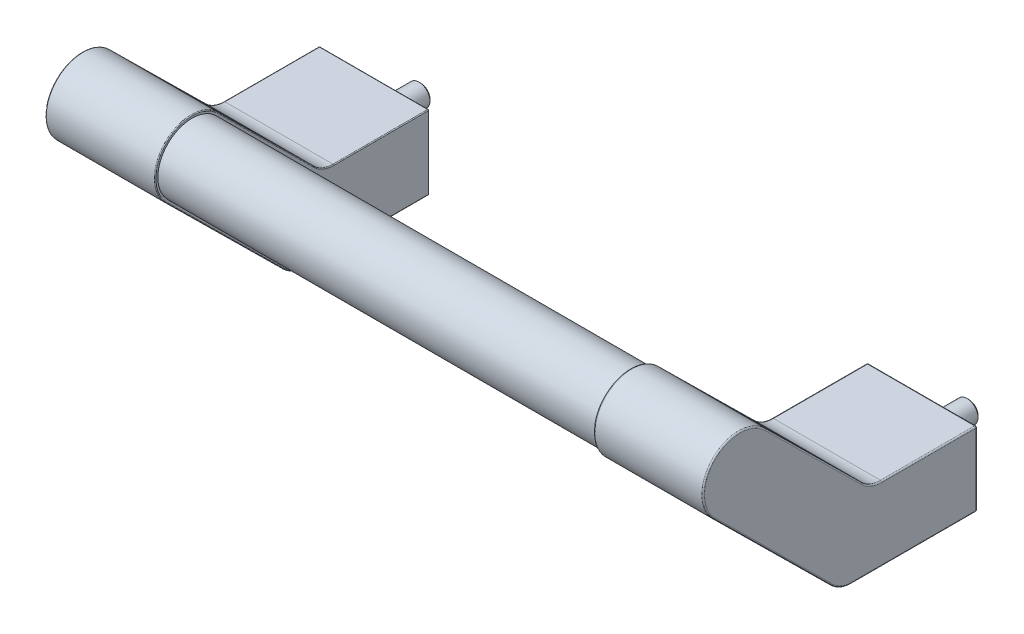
ISO-10303-21;
HEADER;
FILE_DESCRIPTION(('STEP AP214'),'2;1');
FILE_NAME('part.step','',(''),(''),'','','');
FILE_SCHEMA(('AUTOMOTIVE_DESIGN { 1 0 10303 214 1 1 1 1 }'));
ENDSEC;
DATA;
#1=APPLICATION_CONTEXT('core data for automotive mechanical design processes');
#2=APPLICATION_PROTOCOL_DEFINITION('international standard','automotive_design',2000,#1);
#3=PRODUCT_CONTEXT('',#1,'mechanical');
#4=PRODUCT('Part','Part','',(#3));
#5=PRODUCT_RELATED_PRODUCT_CATEGORY('part','',(#4));
#6=PRODUCT_DEFINITION_FORMATION('','',#4);
#7=PRODUCT_DEFINITION_CONTEXT('part definition',#1,'design');
#8=PRODUCT_DEFINITION('design','',#6,#7);
#9=PRODUCT_DEFINITION_SHAPE('','',#8);
#10=(LENGTH_UNIT() NAMED_UNIT(*) SI_UNIT(.MILLI.,.METRE.));
#11=(NAMED_UNIT(*) PLANE_ANGLE_UNIT() SI_UNIT($,.RADIAN.));
#12=(NAMED_UNIT(*) SI_UNIT($,.STERADIAN.) SOLID_ANGLE_UNIT());
#13=UNCERTAINTY_MEASURE_WITH_UNIT(LENGTH_MEASURE(1.E-05),#10,'distance_accuracy_value','');
#14=(GEOMETRIC_REPRESENTATION_CONTEXT(3) GLOBAL_UNCERTAINTY_ASSIGNED_CONTEXT((#13)) GLOBAL_UNIT_ASSIGNED_CONTEXT((#10,
#11,#12)) REPRESENTATION_CONTEXT('',''));
#15=CARTESIAN_POINT('',(0.,0.,0.));
#16=DIRECTION('',(0.,0.,1.));
#17=DIRECTION('',(1.,0.,0.));
#18=AXIS2_PLACEMENT_3D('',#15,#16,#17);
#19=CARTESIAN_POINT('',(200.,2.51534904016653E-13,52.0000000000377));
#20=DIRECTION('',(0.,0.,1.));
#21=DIRECTION('',(-1.,0.,0.));
#22=AXIS2_PLACEMENT_3D('',#19,#20,#21);
#23=CONICAL_SURFACE('',#22,3.00999999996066,1.04719755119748);
#24=CARTESIAN_POINT('',(200.,2.51534904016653E-13,50.262175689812));
#25=VERTEX_POINT('',#24);
#26=VERTEX_LOOP('',#25);
#27=FACE_BOUND('',#26,.T.);
#28=CARTESIAN_POINT('',(200.,2.51534904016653E-13,52.0000000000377));
#29=DIRECTION('',(0.,0.,1.));
#30=DIRECTION('',(-1.,0.,0.));
#31=AXIS2_PLACEMENT_3D('',#28,#29,#30);
#32=CIRCLE('',#31,3.00999999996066);
#33=CARTESIAN_POINT('',(198.49500000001,2.60673646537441,52.0000000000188));
#34=VERTEX_POINT('',#33);
#35=CARTESIAN_POINT('',(196.99,2.65943083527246E-13,52.0000000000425));
#36=VERTEX_POINT('',#35);
#37=EDGE_CURVE('E90',#34,#36,#32,.T.);
#38=ORIENTED_EDGE('',*,*,#37,.T.);
#39=CARTESIAN_POINT('',(200.,2.51534904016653E-13,52.0000000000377));
#40=DIRECTION('',(0.,0.,1.));
#41=DIRECTION('',(-1.,0.,0.));
#42=AXIS2_PLACEMENT_3D('',#39,#40,#41);
#43=CIRCLE('',#42,3.00999999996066);
#44=CARTESIAN_POINT('',(198.495000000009,-2.60673646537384,52.0000000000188));
#45=VERTEX_POINT('',#44);
#46=EDGE_CURVE('E93',#36,#45,#43,.T.);
#47=ORIENTED_EDGE('',*,*,#46,.T.);
#48=CARTESIAN_POINT('',(200.,2.51534904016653E-13,52.0000000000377));
#49=DIRECTION('',(0.,0.,1.));
#50=DIRECTION('',(-1.,0.,0.));
#51=AXIS2_PLACEMENT_3D('',#48,#49,#50);
#52=CIRCLE('',#51,3.00999999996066);
#53=CARTESIAN_POINT('',(201.50499999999,-2.60673646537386,52.0000000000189));
#54=VERTEX_POINT('',#53);
#55=EDGE_CURVE('E95',#45,#54,#52,.T.);
#56=ORIENTED_EDGE('',*,*,#55,.T.);
#57=CARTESIAN_POINT('',(200.,2.51534904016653E-13,52.0000000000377));
#58=DIRECTION('',(0.,0.,1.));
#59=DIRECTION('',(-1.,0.,0.));
#60=AXIS2_PLACEMENT_3D('',#57,#58,#59);
#61=CIRCLE('',#60,3.00999999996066);
#62=CARTESIAN_POINT('',(203.01,9.24077220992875E-13,52.0000000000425));
#63=VERTEX_POINT('',#62);
#64=EDGE_CURVE('E110',#54,#63,#61,.T.);
#65=ORIENTED_EDGE('',*,*,#64,.T.);
#66=CARTESIAN_POINT('',(200.,2.51534904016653E-13,52.0000000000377));
#67=DIRECTION('',(0.,0.,1.));
#68=DIRECTION('',(-1.,0.,0.));
#69=AXIS2_PLACEMENT_3D('',#66,#67,#68);
#70=CIRCLE('',#69,3.00999999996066);
#71=CARTESIAN_POINT('',(201.504999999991,2.60673646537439,52.0000000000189));
#72=VERTEX_POINT('',#71);
#73=EDGE_CURVE('E111',#63,#72,#70,.T.);
#74=ORIENTED_EDGE('',*,*,#73,.T.);
#75=CARTESIAN_POINT('',(200.,2.51534904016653E-13,52.0000000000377));
#76=DIRECTION('',(0.,0.,1.));
#77=DIRECTION('',(-1.,0.,0.));
#78=AXIS2_PLACEMENT_3D('',#75,#76,#77);
#79=CIRCLE('',#78,3.00999999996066);
#80=EDGE_CURVE('E218',#72,#34,#79,.T.);
#81=ORIENTED_EDGE('',*,*,#80,.T.);
#82=EDGE_LOOP('',(#38,#47,#56,#65,#74,#81));
#83=FACE_BOUND('',#82,.T.);
#84=ADVANCED_FACE('F14',(#27,#83),#23,.F.);
#85=CARTESIAN_POINT('',(203.01,-5.21347293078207,52.));
#86=DIRECTION('',(0.,0.,-1.));
#87=DIRECTION('',(1.,0.,0.));
#88=AXIS2_PLACEMENT_3D('',#85,#86,#87);
#89=PLANE('',#88);
#90=DIRECTION('',(0.866025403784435,-0.500000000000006,0.));
#91=VECTOR('',#90,1.);
#92=CARTESIAN_POINT('',(200.,-3.47564862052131,52.));
#93=LINE('',#92,#91);
#94=CARTESIAN_POINT('',(196.99,-1.73782431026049,52.));
#95=VERTEX_POINT('',#94);
#96=EDGE_CURVE('E114',#45,#95,#93,.F.);
#97=ORIENTED_EDGE('',*,*,#96,.F.);
#98=ORIENTED_EDGE('',*,*,#46,.F.);
#99=DIRECTION('',(0.,1.,0.));
#100=VECTOR('',#99,1.);
#101=CARTESIAN_POINT('',(196.99,1.73782431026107,52.));
#102=LINE('',#101,#100);
#103=EDGE_CURVE('E116',#36,#95,#102,.F.);
#104=ORIENTED_EDGE('',*,*,#103,.T.);
#105=EDGE_LOOP('',(#97,#98,#104));
#106=FACE_BOUND('',#105,.T.);
#107=ADVANCED_FACE('F115',(#106),#89,.F.);
#108=CARTESIAN_POINT('',(203.01,-5.21347293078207,52.));
#109=DIRECTION('',(0.,0.,-1.));
#110=DIRECTION('',(1.,0.,0.));
#111=AXIS2_PLACEMENT_3D('',#108,#109,#110);
#112=PLANE('',#111);
#113=DIRECTION('',(0.,1.,0.));
#114=VECTOR('',#113,1.);
#115=CARTESIAN_POINT('',(196.99,1.73782431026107,52.));
#116=LINE('',#115,#114);
#117=CARTESIAN_POINT('',(196.99,1.73782431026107,52.));
#118=VERTEX_POINT('',#117);
#119=EDGE_CURVE('E120',#118,#36,#116,.F.);
#120=ORIENTED_EDGE('',*,*,#119,.T.);
#121=ORIENTED_EDGE('',*,*,#37,.F.);
#122=DIRECTION('',(-0.866025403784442,-0.499999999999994,0.));
#123=VECTOR('',#122,1.);
#124=CARTESIAN_POINT('',(196.99,1.73782431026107,52.));
#125=LINE('',#124,#123);
#126=EDGE_CURVE('E173',#118,#34,#125,.F.);
#127=ORIENTED_EDGE('',*,*,#126,.F.);
#128=EDGE_LOOP('',(#120,#121,#127));
#129=FACE_BOUND('',#128,.T.);
#130=ADVANCED_FACE('F228',(#129),#112,.F.);
#131=CARTESIAN_POINT('',(203.01,-5.21347293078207,52.));
#132=DIRECTION('',(0.,0.,-1.));
#133=DIRECTION('',(1.,0.,0.));
#134=AXIS2_PLACEMENT_3D('',#131,#132,#133);
#135=PLANE('',#134);
#136=DIRECTION('',(-0.866025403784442,-0.499999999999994,0.));
#137=VECTOR('',#136,1.);
#138=CARTESIAN_POINT('',(196.99,1.73782431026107,52.));
#139=LINE('',#138,#137);
#140=CARTESIAN_POINT('',(200.,3.47564862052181,52.));
#141=VERTEX_POINT('',#140);
#142=EDGE_CURVE('E169',#34,#141,#139,.F.);
#143=ORIENTED_EDGE('',*,*,#142,.F.);
#144=ORIENTED_EDGE('',*,*,#80,.F.);
#145=DIRECTION('',(-0.866025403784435,0.500000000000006,0.));
#146=VECTOR('',#145,1.);
#147=CARTESIAN_POINT('',(200.,3.47564862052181,52.));
#148=LINE('',#147,#146);
#149=EDGE_CURVE('E155',#141,#72,#148,.F.);
#150=ORIENTED_EDGE('',*,*,#149,.F.);
#151=EDGE_LOOP('',(#143,#144,#150));
#152=FACE_BOUND('',#151,.T.);
#153=ADVANCED_FACE('F229',(#152),#135,.F.);
#154=CARTESIAN_POINT('',(203.01,-5.21347293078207,52.));
#155=DIRECTION('',(0.,0.,-1.));
#156=DIRECTION('',(1.,0.,0.));
#157=AXIS2_PLACEMENT_3D('',#154,#155,#156);
#158=PLANE('',#157);
#159=DIRECTION('',(-0.866025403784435,0.500000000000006,0.));
#160=VECTOR('',#159,1.);
#161=CARTESIAN_POINT('',(200.,3.47564862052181,52.));
#162=LINE('',#161,#160);
#163=CARTESIAN_POINT('',(203.01,1.73782431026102,52.));
#164=VERTEX_POINT('',#163);
#165=EDGE_CURVE('E152',#72,#164,#162,.F.);
#166=ORIENTED_EDGE('',*,*,#165,.F.);
#167=ORIENTED_EDGE('',*,*,#73,.F.);
#168=DIRECTION('',(0.,-1.,0.));
#169=VECTOR('',#168,1.);
#170=CARTESIAN_POINT('',(203.01,-1.73782431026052,52.));
#171=LINE('',#170,#169);
#172=EDGE_CURVE('E146',#63,#164,#171,.F.);
#173=ORIENTED_EDGE('',*,*,#172,.T.);
#174=EDGE_LOOP('',(#166,#167,#173));
#175=FACE_BOUND('',#174,.T.);
#176=ADVANCED_FACE('F298',(#175),#158,.F.);
#177=CARTESIAN_POINT('',(203.01,-5.21347293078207,52.));
#178=DIRECTION('',(0.,0.,-1.));
#179=DIRECTION('',(1.,0.,0.));
#180=AXIS2_PLACEMENT_3D('',#177,#178,#179);
#181=PLANE('',#180);
#182=DIRECTION('',(-0.866025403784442,-0.499999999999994,0.));
#183=VECTOR('',#182,1.);
#184=CARTESIAN_POINT('',(200.,-3.47564862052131,52.));
#185=LINE('',#184,#183);
#186=CARTESIAN_POINT('',(200.,-3.47564862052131,52.));
#187=VERTEX_POINT('',#186);
#188=EDGE_CURVE('E108',#187,#54,#185,.F.);
#189=ORIENTED_EDGE('',*,*,#188,.T.);
#190=ORIENTED_EDGE('',*,*,#55,.F.);
#191=DIRECTION('',(0.866025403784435,-0.500000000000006,0.));
#192=VECTOR('',#191,1.);
#193=CARTESIAN_POINT('',(200.,-3.47564862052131,52.));
#194=LINE('',#193,#192);
#195=EDGE_CURVE('E105',#187,#45,#194,.F.);
#196=ORIENTED_EDGE('',*,*,#195,.F.);
#197=EDGE_LOOP('',(#189,#190,#196));
#198=FACE_BOUND('',#197,.T.);
#199=ADVANCED_FACE('F103',(#198),#181,.F.);
#200=CARTESIAN_POINT('',(203.01,-5.21347293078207,52.));
#201=DIRECTION('',(0.,0.,-1.));
#202=DIRECTION('',(1.,0.,0.));
#203=AXIS2_PLACEMENT_3D('',#200,#201,#202);
#204=PLANE('',#203);
#205=DIRECTION('',(0.,-1.,0.));
#206=VECTOR('',#205,1.);
#207=CARTESIAN_POINT('',(203.01,-1.73782431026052,52.));
#208=LINE('',#207,#206);
#209=CARTESIAN_POINT('',(203.01,-1.73782431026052,52.));
#210=VERTEX_POINT('',#209);
#211=EDGE_CURVE('E149',#210,#63,#208,.F.);
#212=ORIENTED_EDGE('',*,*,#211,.T.);
#213=ORIENTED_EDGE('',*,*,#64,.F.);
#214=DIRECTION('',(-0.866025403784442,-0.499999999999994,0.));
#215=VECTOR('',#214,1.);
#216=CARTESIAN_POINT('',(200.,-3.47564862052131,52.));
#217=LINE('',#216,#215);
#218=EDGE_CURVE('E280',#54,#210,#217,.F.);
#219=ORIENTED_EDGE('',*,*,#218,.T.);
#220=EDGE_LOOP('',(#212,#213,#219));
#221=FACE_BOUND('',#220,.T.);
#222=ADVANCED_FACE('F296',(#221),#204,.F.);
#223=CARTESIAN_POINT('',(200.,-3.47564862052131,52.));
#224=DIRECTION('',(0.500000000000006,0.866025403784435,0.));
#225=DIRECTION('',(0.866025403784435,-0.500000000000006,0.));
#226=AXIS2_PLACEMENT_3D('',#223,#224,#225);
#227=PLANE('',#226);
#228=ORIENTED_EDGE('',*,*,#96,.T.);
#229=DIRECTION('',(0.,0.,-1.));
#230=VECTOR('',#229,1.);
#231=CARTESIAN_POINT('',(196.99,-1.73782431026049,52.));
#232=LINE('',#231,#230);
#233=CARTESIAN_POINT('',(196.99,-1.73782431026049,56.));
#234=VERTEX_POINT('',#233);
#235=EDGE_CURVE('E193',#95,#234,#232,.F.);
#236=ORIENTED_EDGE('',*,*,#235,.T.);
#237=DIRECTION('',(-0.866025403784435,0.500000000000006,0.));
#238=VECTOR('',#237,1.);
#239=CARTESIAN_POINT('',(200.,-3.47564862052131,56.));
#240=LINE('',#239,#238);
#241=CARTESIAN_POINT('',(200.,-3.47564862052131,56.));
#242=VERTEX_POINT('',#241);
#243=EDGE_CURVE('E133',#242,#234,#240,.T.);
#244=ORIENTED_EDGE('',*,*,#243,.F.);
#245=DIRECTION('',(0.,0.,-1.));
#246=VECTOR('',#245,1.);
#247=CARTESIAN_POINT('',(200.,-3.47564862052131,52.));
#248=LINE('',#247,#246);
#249=EDGE_CURVE('E124',#242,#187,#248,.T.);
#250=ORIENTED_EDGE('',*,*,#249,.T.);
#251=ORIENTED_EDGE('',*,*,#195,.T.);
#252=EDGE_LOOP('',(#228,#236,#244,#250,#251));
#253=FACE_BOUND('',#252,.T.);
#254=ADVANCED_FACE('F122',(#253),#227,.T.);
#255=CARTESIAN_POINT('',(196.99,1.73782431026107,52.));
#256=DIRECTION('',(-1.,0.,0.));
#257=DIRECTION('',(0.,1.,0.));
#258=AXIS2_PLACEMENT_3D('',#255,#256,#257);
#259=PLANE('',#258);
#260=ORIENTED_EDGE('',*,*,#235,.F.);
#261=ORIENTED_EDGE('',*,*,#103,.F.);
#262=ORIENTED_EDGE('',*,*,#119,.F.);
#263=DIRECTION('',(0.,0.,-1.));
#264=VECTOR('',#263,1.);
#265=CARTESIAN_POINT('',(196.99,1.73782431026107,52.));
#266=LINE('',#265,#264);
#267=CARTESIAN_POINT('',(196.99,1.73782431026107,56.));
#268=VERTEX_POINT('',#267);
#269=EDGE_CURVE('E188',#268,#118,#266,.T.);
#270=ORIENTED_EDGE('',*,*,#269,.F.);
#271=DIRECTION('',(0.,-1.,0.));
#272=VECTOR('',#271,1.);
#273=CARTESIAN_POINT('',(196.99,2.65943083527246E-13,56.));
#274=LINE('',#273,#272);
#275=EDGE_CURVE('E136',#234,#268,#274,.F.);
#276=ORIENTED_EDGE('',*,*,#275,.F.);
#277=EDGE_LOOP('',(#260,#261,#262,#270,#276));
#278=FACE_BOUND('',#277,.T.);
#279=ADVANCED_FACE('F235',(#278),#259,.F.);
#280=CARTESIAN_POINT('',(196.99,1.73782431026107,52.));
#281=DIRECTION('',(0.499999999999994,-0.866025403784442,0.));
#282=DIRECTION('',(-0.866025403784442,-0.499999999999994,0.));
#283=AXIS2_PLACEMENT_3D('',#280,#281,#282);
#284=PLANE('',#283);
#285=ORIENTED_EDGE('',*,*,#142,.T.);
#286=DIRECTION('',(0.,0.,-1.));
#287=VECTOR('',#286,1.);
#288=CARTESIAN_POINT('',(200.,3.47564862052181,52.));
#289=LINE('',#288,#287);
#290=CARTESIAN_POINT('',(200.,3.47564862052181,56.));
#291=VERTEX_POINT('',#290);
#292=EDGE_CURVE('E164',#291,#141,#289,.T.);
#293=ORIENTED_EDGE('',*,*,#292,.F.);
#294=DIRECTION('',(0.866025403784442,0.499999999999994,0.));
#295=VECTOR('',#294,1.);
#296=CARTESIAN_POINT('',(196.99,1.73782431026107,56.));
#297=LINE('',#296,#295);
#298=EDGE_CURVE('E179',#268,#291,#297,.T.);
#299=ORIENTED_EDGE('',*,*,#298,.F.);
#300=ORIENTED_EDGE('',*,*,#269,.T.);
#301=ORIENTED_EDGE('',*,*,#126,.T.);
#302=EDGE_LOOP('',(#285,#293,#299,#300,#301));
#303=FACE_BOUND('',#302,.T.);
#304=ADVANCED_FACE('F231',(#303),#284,.T.);
#305=CARTESIAN_POINT('',(200.,3.47564862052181,52.));
#306=DIRECTION('',(-0.500000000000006,-0.866025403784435,0.));
#307=DIRECTION('',(-0.866025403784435,0.500000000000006,0.));
#308=AXIS2_PLACEMENT_3D('',#305,#306,#307);
#309=PLANE('',#308);
#310=ORIENTED_EDGE('',*,*,#165,.T.);
#311=DIRECTION('',(0.,0.,-1.));
#312=VECTOR('',#311,1.);
#313=CARTESIAN_POINT('',(203.01,1.73782431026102,52.));
#314=LINE('',#313,#312);
#315=CARTESIAN_POINT('',(203.01,1.73782431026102,56.));
#316=VERTEX_POINT('',#315);
#317=EDGE_CURVE('E148',#164,#316,#314,.F.);
#318=ORIENTED_EDGE('',*,*,#317,.T.);
#319=DIRECTION('',(0.866025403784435,-0.500000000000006,0.));
#320=VECTOR('',#319,1.);
#321=CARTESIAN_POINT('',(200.,3.47564862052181,56.));
#322=LINE('',#321,#320);
#323=EDGE_CURVE('E176',#291,#316,#322,.T.);
#324=ORIENTED_EDGE('',*,*,#323,.F.);
#325=ORIENTED_EDGE('',*,*,#292,.T.);
#326=ORIENTED_EDGE('',*,*,#149,.T.);
#327=EDGE_LOOP('',(#310,#318,#324,#325,#326));
#328=FACE_BOUND('',#327,.T.);
#329=ADVANCED_FACE('F300',(#328),#309,.T.);
#330=CARTESIAN_POINT('',(203.01,-1.73782431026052,52.));
#331=DIRECTION('',(1.,0.,0.));
#332=DIRECTION('',(0.,-1.,0.));
#333=AXIS2_PLACEMENT_3D('',#330,#331,#332);
#334=PLANE('',#333);
#335=ORIENTED_EDGE('',*,*,#317,.F.);
#336=ORIENTED_EDGE('',*,*,#172,.F.);
#337=ORIENTED_EDGE('',*,*,#211,.F.);
#338=DIRECTION('',(0.,0.,-1.));
#339=VECTOR('',#338,1.);
#340=CARTESIAN_POINT('',(203.01,-1.73782431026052,52.));
#341=LINE('',#340,#339);
#342=CARTESIAN_POINT('',(203.01,-1.73782431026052,56.));
#343=VERTEX_POINT('',#342);
#344=EDGE_CURVE('E137',#210,#343,#341,.F.);
#345=ORIENTED_EDGE('',*,*,#344,.T.);
#346=DIRECTION('',(0.,-1.,0.));
#347=VECTOR('',#346,1.);
#348=CARTESIAN_POINT('',(203.01,2.3018783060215E-13,56.));
#349=LINE('',#348,#347);
#350=EDGE_CURVE('E143',#316,#343,#349,.T.);
#351=ORIENTED_EDGE('',*,*,#350,.F.);
#352=EDGE_LOOP('',(#335,#336,#337,#345,#351));
#353=FACE_BOUND('',#352,.T.);
#354=ADVANCED_FACE('F293',(#353),#334,.F.);
#355=CARTESIAN_POINT('',(200.,-3.47564862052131,52.));
#356=DIRECTION('',(0.499999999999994,-0.866025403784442,0.));
#357=DIRECTION('',(-0.866025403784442,-0.499999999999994,0.));
#358=AXIS2_PLACEMENT_3D('',#355,#356,#357);
#359=PLANE('',#358);
#360=ORIENTED_EDGE('',*,*,#344,.F.);
#361=ORIENTED_EDGE('',*,*,#218,.F.);
#362=ORIENTED_EDGE('',*,*,#188,.F.);
#363=ORIENTED_EDGE('',*,*,#249,.F.);
#364=DIRECTION('',(-0.866025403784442,-0.499999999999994,0.));
#365=VECTOR('',#364,1.);
#366=CARTESIAN_POINT('',(203.01,-1.73782431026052,56.));
#367=LINE('',#366,#365);
#368=EDGE_CURVE('E140',#343,#242,#367,.T.);
#369=ORIENTED_EDGE('',*,*,#368,.F.);
#370=EDGE_LOOP('',(#360,#361,#362,#363,#369));
#371=FACE_BOUND('',#370,.T.);
#372=ADVANCED_FACE('F240',(#371),#359,.F.);
#373=CARTESIAN_POINT('',(200.,2.51534904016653E-13,56.));
#374=DIRECTION('',(0.,0.,1.));
#375=DIRECTION('',(-1.,0.,0.));
#376=AXIS2_PLACEMENT_3D('',#373,#374,#375);
#377=PLANE('',#376);
#378=CARTESIAN_POINT('',(200.,2.51534904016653E-13,55.9999999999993));
#379=DIRECTION('',(0.,0.,-1.));
#380=DIRECTION('',(1.,0.,0.));
#381=AXIS2_PLACEMENT_3D('',#378,#379,#380);
#382=CIRCLE('',#381,5.70000000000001);
#383=CARTESIAN_POINT('',(205.7,2.06384388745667E-13,56.));
#384=VERTEX_POINT('',#383);
#385=CARTESIAN_POINT('',(194.3,2.8974652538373E-13,55.9999999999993));
#386=VERTEX_POINT('',#385);
#387=EDGE_CURVE('E34',#384,#386,#382,.T.);
#388=ORIENTED_EDGE('',*,*,#387,.F.);
#389=CARTESIAN_POINT('',(200.,2.51534904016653E-13,55.9999999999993));
#390=DIRECTION('',(0.,0.,-1.));
#391=DIRECTION('',(-1.,0.,0.));
#392=AXIS2_PLACEMENT_3D('',#389,#390,#391);
#393=CIRCLE('',#392,5.70000000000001);
#394=EDGE_CURVE('E2745',#386,#384,#393,.T.);
#395=ORIENTED_EDGE('',*,*,#394,.F.);
#396=EDGE_LOOP('',(#388,#395));
#397=FACE_BOUND('',#396,.T.);
#398=ORIENTED_EDGE('',*,*,#350,.T.);
#399=ORIENTED_EDGE('',*,*,#368,.T.);
#400=ORIENTED_EDGE('',*,*,#243,.T.);
#401=ORIENTED_EDGE('',*,*,#275,.T.);
#402=ORIENTED_EDGE('',*,*,#298,.T.);
#403=ORIENTED_EDGE('',*,*,#323,.T.);
#404=EDGE_LOOP('',(#398,#399,#400,#401,#402,#403));
#405=FACE_BOUND('',#404,.T.);
#406=ADVANCED_FACE('F243',(#397,#405),#377,.T.);
#407=CARTESIAN_POINT('',(200.,2.51534904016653E-13,55.1999999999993));
#408=DIRECTION('',(0.,0.,1.));
#409=DIRECTION('',(-1.,0.,0.));
#410=AXIS2_PLACEMENT_3D('',#407,#408,#409);
#411=TOROIDAL_SURFACE('',#410,5.70000000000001,0.8);
#412=CARTESIAN_POINT('',(200.,2.51534904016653E-13,55.2));
#413=DIRECTION('',(0.,0.,1.));
#414=DIRECTION('',(-1.,0.,0.));
#415=AXIS2_PLACEMENT_3D('',#412,#413,#414);
#416=CIRCLE('',#415,6.5);
#417=CARTESIAN_POINT('',(193.5,2.97196918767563E-13,55.2));
#418=VERTEX_POINT('',#417);
#419=EDGE_CURVE('E215',#418,#418,#416,.F.);
#420=ORIENTED_EDGE('',*,*,#419,.F.);
#421=EDGE_LOOP('',(#420));
#422=FACE_BOUND('',#421,.T.);
#423=ORIENTED_EDGE('',*,*,#394,.T.);
#424=ORIENTED_EDGE('',*,*,#387,.T.);
#425=EDGE_LOOP('',(#423,#424));
#426=FACE_BOUND('',#425,.T.);
#427=ADVANCED_FACE('F259',(#422,#426),#411,.T.);
#428=CARTESIAN_POINT('',(200.,2.51534904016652E-13,87.75));
#429=DIRECTION('',(0.,0.,1.));
#430=DIRECTION('',(-1.,0.,0.));
#431=AXIS2_PLACEMENT_3D('',#428,#429,#430);
#432=CYLINDRICAL_SURFACE('',#431,6.5);
#433=CARTESIAN_POINT('',(200.,2.51534904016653E-13,48.));
#434=DIRECTION('',(0.,0.,1.));
#435=DIRECTION('',(-1.,0.,0.));
#436=AXIS2_PLACEMENT_3D('',#433,#434,#435);
#437=CIRCLE('',#436,6.5);
#438=CARTESIAN_POINT('',(193.5,2.97196918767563E-13,48.));
#439=VERTEX_POINT('',#438);
#440=EDGE_CURVE('E213',#439,#439,#437,.F.);
#441=ORIENTED_EDGE('',*,*,#440,.F.);
#442=EDGE_LOOP('',(#441));
#443=FACE_BOUND('',#442,.T.);
#444=ORIENTED_EDGE('',*,*,#419,.T.);
#445=EDGE_LOOP('',(#444));
#446=FACE_BOUND('',#445,.T.);
#447=ADVANCED_FACE('F263',(#443,#446),#432,.T.);
#448=CARTESIAN_POINT('',(0.,0.,52.0000000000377));
#449=DIRECTION('',(0.,0.,1.));
#450=DIRECTION('',(-1.,0.,0.));
#451=AXIS2_PLACEMENT_3D('',#448,#449,#450);
#452=CONICAL_SURFACE('',#451,3.00999999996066,1.04719755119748);
#453=CARTESIAN_POINT('',(0.,0.,50.262175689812));
#454=VERTEX_POINT('',#453);
#455=VERTEX_LOOP('',#454);
#456=FACE_BOUND('',#455,.T.);
#457=CARTESIAN_POINT('',(0.,0.,52.0000000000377));
#458=DIRECTION('',(0.,0.,1.));
#459=DIRECTION('',(-1.,0.,0.));
#460=AXIS2_PLACEMENT_3D('',#457,#458,#459);
#461=CIRCLE('',#460,3.00999999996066);
#462=CARTESIAN_POINT('',(-1.50499999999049,2.60673646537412,52.0000000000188));
#463=VERTEX_POINT('',#462);
#464=CARTESIAN_POINT('',(-3.01,0.,52.0000000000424));
#465=VERTEX_POINT('',#464);
#466=EDGE_CURVE('E629',#463,#465,#461,.T.);
#467=ORIENTED_EDGE('',*,*,#466,.T.);
#468=CARTESIAN_POINT('',(0.,0.,52.0000000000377));
#469=DIRECTION('',(0.,0.,1.));
#470=DIRECTION('',(-1.,0.,0.));
#471=AXIS2_PLACEMENT_3D('',#468,#469,#470);
#472=CIRCLE('',#471,3.00999999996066);
#473=CARTESIAN_POINT('',(-1.50499999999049,-2.60673646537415,52.0000000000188));
#474=VERTEX_POINT('',#473);
#475=EDGE_CURVE('E626',#465,#474,#472,.T.);
#476=ORIENTED_EDGE('',*,*,#475,.T.);
#477=CARTESIAN_POINT('',(0.,0.,52.0000000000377));
#478=DIRECTION('',(0.,0.,1.));
#479=DIRECTION('',(-1.,0.,0.));
#480=AXIS2_PLACEMENT_3D('',#477,#478,#479);
#481=CIRCLE('',#480,3.00999999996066);
#482=CARTESIAN_POINT('',(1.50499999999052,-2.60673646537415,52.0000000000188));
#483=VERTEX_POINT('',#482);
#484=EDGE_CURVE('E1289',#474,#483,#481,.T.);
#485=ORIENTED_EDGE('',*,*,#484,.T.);
#486=CARTESIAN_POINT('',(0.,0.,52.0000000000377));
#487=DIRECTION('',(0.,0.,1.));
#488=DIRECTION('',(-1.,0.,0.));
#489=AXIS2_PLACEMENT_3D('',#486,#487,#488);
#490=CIRCLE('',#489,3.00999999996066);
#491=CARTESIAN_POINT('',(3.01,6.79481210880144E-13,52.0000000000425));
#492=VERTEX_POINT('',#491);
#493=EDGE_CURVE('E1287',#483,#492,#490,.T.);
#494=ORIENTED_EDGE('',*,*,#493,.T.);
#495=CARTESIAN_POINT('',(0.,0.,52.0000000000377));
#496=DIRECTION('',(0.,0.,1.));
#497=DIRECTION('',(-1.,0.,0.));
#498=AXIS2_PLACEMENT_3D('',#495,#496,#497);
#499=CIRCLE('',#498,3.00999999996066);
#500=CARTESIAN_POINT('',(1.50499999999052,2.60673646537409,52.0000000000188));
#501=VERTEX_POINT('',#500);
#502=EDGE_CURVE('E1291',#492,#501,#499,.T.);
#503=ORIENTED_EDGE('',*,*,#502,.T.);
#504=CARTESIAN_POINT('',(0.,0.,52.0000000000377));
#505=DIRECTION('',(0.,0.,1.));
#506=DIRECTION('',(-1.,0.,0.));
#507=AXIS2_PLACEMENT_3D('',#504,#505,#506);
#508=CIRCLE('',#507,3.00999999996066);
#509=EDGE_CURVE('E1293',#501,#463,#508,.T.);
#510=ORIENTED_EDGE('',*,*,#509,.T.);
#511=EDGE_LOOP('',(#467,#476,#485,#494,#503,#510));
#512=FACE_BOUND('',#511,.T.);
#513=ADVANCED_FACE('F1098',(#456,#512),#452,.F.);
#514=CARTESIAN_POINT('',(3.01,-5.21347293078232,52.));
#515=DIRECTION('',(0.,0.,-1.));
#516=DIRECTION('',(1.,0.,0.));
#517=AXIS2_PLACEMENT_3D('',#514,#515,#516);
#518=PLANE('',#517);
#519=DIRECTION('',(-0.866025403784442,-0.499999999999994,0.));
#520=VECTOR('',#519,1.);
#521=CARTESIAN_POINT('',(-3.01,1.73782431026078,52.));
#522=LINE('',#521,#520);
#523=CARTESIAN_POINT('',(0.,3.47564862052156,52.));
#524=VERTEX_POINT('',#523);
#525=EDGE_CURVE('E1231',#463,#524,#522,.F.);
#526=ORIENTED_EDGE('',*,*,#525,.F.);
#527=ORIENTED_EDGE('',*,*,#509,.F.);
#528=DIRECTION('',(-0.866025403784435,0.500000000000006,0.));
#529=VECTOR('',#528,1.);
#530=CARTESIAN_POINT('',(0.,3.47564862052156,52.));
#531=LINE('',#530,#529);
#532=EDGE_CURVE('E1217',#524,#501,#531,.F.);
#533=ORIENTED_EDGE('',*,*,#532,.F.);
#534=EDGE_LOOP('',(#526,#527,#533));
#535=FACE_BOUND('',#534,.T.);
#536=ADVANCED_FACE('F1111',(#535),#518,.F.);
#537=CARTESIAN_POINT('',(3.01,-5.21347293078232,52.));
#538=DIRECTION('',(0.,0.,-1.));
#539=DIRECTION('',(1.,0.,0.));
#540=AXIS2_PLACEMENT_3D('',#537,#538,#539);
#541=PLANE('',#540);
#542=DIRECTION('',(0.,1.,0.));
#543=VECTOR('',#542,1.);
#544=CARTESIAN_POINT('',(-3.01,1.73782431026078,52.));
#545=LINE('',#544,#543);
#546=CARTESIAN_POINT('',(-3.01,1.73782431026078,52.));
#547=VERTEX_POINT('',#546);
#548=EDGE_CURVE('E1258',#547,#465,#545,.F.);
#549=ORIENTED_EDGE('',*,*,#548,.T.);
#550=ORIENTED_EDGE('',*,*,#466,.F.);
#551=DIRECTION('',(-0.866025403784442,-0.499999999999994,0.));
#552=VECTOR('',#551,1.);
#553=CARTESIAN_POINT('',(-3.01,1.73782431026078,52.));
#554=LINE('',#553,#552);
#555=EDGE_CURVE('E1235',#547,#463,#554,.F.);
#556=ORIENTED_EDGE('',*,*,#555,.F.);
#557=EDGE_LOOP('',(#549,#550,#556));
#558=FACE_BOUND('',#557,.T.);
#559=ADVANCED_FACE('F1117',(#558),#541,.F.);
#560=CARTESIAN_POINT('',(3.01,-5.21347293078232,52.));
#561=DIRECTION('',(0.,0.,-1.));
#562=DIRECTION('',(1.,0.,0.));
#563=AXIS2_PLACEMENT_3D('',#560,#561,#562);
#564=PLANE('',#563);
#565=DIRECTION('',(0.866025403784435,-0.500000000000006,0.));
#566=VECTOR('',#565,1.);
#567=CARTESIAN_POINT('',(0.,-3.47564862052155,52.));
#568=LINE('',#567,#566);
#569=CARTESIAN_POINT('',(-3.01,-1.73782431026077,52.));
#570=VERTEX_POINT('',#569);
#571=EDGE_CURVE('E1262',#474,#570,#568,.F.);
#572=ORIENTED_EDGE('',*,*,#571,.F.);
#573=ORIENTED_EDGE('',*,*,#475,.F.);
#574=DIRECTION('',(0.,1.,0.));
#575=VECTOR('',#574,1.);
#576=CARTESIAN_POINT('',(-3.01,1.73782431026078,52.));
#577=LINE('',#576,#575);
#578=EDGE_CURVE('E1261',#465,#570,#577,.F.);
#579=ORIENTED_EDGE('',*,*,#578,.T.);
#580=EDGE_LOOP('',(#572,#573,#579));
#581=FACE_BOUND('',#580,.T.);
#582=ADVANCED_FACE('F1113',(#581),#564,.F.);
#583=CARTESIAN_POINT('',(3.01,-5.21347293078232,52.));
#584=DIRECTION('',(0.,0.,-1.));
#585=DIRECTION('',(1.,0.,0.));
#586=AXIS2_PLACEMENT_3D('',#583,#584,#585);
#587=PLANE('',#586);
#588=DIRECTION('',(-0.866025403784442,-0.499999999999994,0.));
#589=VECTOR('',#588,1.);
#590=CARTESIAN_POINT('',(0.,-3.47564862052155,52.));
#591=LINE('',#590,#589);
#592=CARTESIAN_POINT('',(0.,-3.47564862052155,52.));
#593=VERTEX_POINT('',#592);
#594=EDGE_CURVE('E2836',#593,#483,#591,.F.);
#595=ORIENTED_EDGE('',*,*,#594,.T.);
#596=ORIENTED_EDGE('',*,*,#484,.F.);
#597=DIRECTION('',(0.866025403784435,-0.500000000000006,0.));
#598=VECTOR('',#597,1.);
#599=CARTESIAN_POINT('',(0.,-3.47564862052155,52.));
#600=LINE('',#599,#598);
#601=EDGE_CURVE('E1275',#593,#474,#600,.F.);
#602=ORIENTED_EDGE('',*,*,#601,.F.);
#603=EDGE_LOOP('',(#595,#596,#602));
#604=FACE_BOUND('',#603,.T.);
#605=ADVANCED_FACE('F1116',(#604),#587,.F.);
#606=CARTESIAN_POINT('',(3.01,-5.21347293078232,52.));
#607=DIRECTION('',(0.,0.,-1.));
#608=DIRECTION('',(1.,0.,0.));
#609=AXIS2_PLACEMENT_3D('',#606,#607,#608);
#610=PLANE('',#609);
#611=DIRECTION('',(0.,-1.,0.));
#612=VECTOR('',#611,1.);
#613=CARTESIAN_POINT('',(3.01,-1.73782431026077,52.));
#614=LINE('',#613,#612);
#615=CARTESIAN_POINT('',(3.01,-1.73782431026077,52.));
#616=VERTEX_POINT('',#615);
#617=EDGE_CURVE('E1211',#616,#492,#614,.F.);
#618=ORIENTED_EDGE('',*,*,#617,.T.);
#619=ORIENTED_EDGE('',*,*,#493,.F.);
#620=DIRECTION('',(-0.866025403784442,-0.499999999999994,0.));
#621=VECTOR('',#620,1.);
#622=CARTESIAN_POINT('',(0.,-3.47564862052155,52.));
#623=LINE('',#622,#621);
#624=EDGE_CURVE('E2844',#483,#616,#623,.F.);
#625=ORIENTED_EDGE('',*,*,#624,.T.);
#626=EDGE_LOOP('',(#618,#619,#625));
#627=FACE_BOUND('',#626,.T.);
#628=ADVANCED_FACE('F1129',(#627),#610,.F.);
#629=CARTESIAN_POINT('',(3.01,-5.21347293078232,52.));
#630=DIRECTION('',(0.,0.,-1.));
#631=DIRECTION('',(1.,0.,0.));
#632=AXIS2_PLACEMENT_3D('',#629,#630,#631);
#633=PLANE('',#632);
#634=DIRECTION('',(-0.866025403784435,0.500000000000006,0.));
#635=VECTOR('',#634,1.);
#636=CARTESIAN_POINT('',(0.,3.47564862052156,52.));
#637=LINE('',#636,#635);
#638=CARTESIAN_POINT('',(3.01,1.73782431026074,52.));
#639=VERTEX_POINT('',#638);
#640=EDGE_CURVE('E1214',#501,#639,#637,.F.);
#641=ORIENTED_EDGE('',*,*,#640,.F.);
#642=ORIENTED_EDGE('',*,*,#502,.F.);
#643=DIRECTION('',(0.,-1.,0.));
#644=VECTOR('',#643,1.);
#645=CARTESIAN_POINT('',(3.01,-1.73782431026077,52.));
#646=LINE('',#645,#644);
#647=EDGE_CURVE('E1208',#492,#639,#646,.F.);
#648=ORIENTED_EDGE('',*,*,#647,.T.);
#649=EDGE_LOOP('',(#641,#642,#648));
#650=FACE_BOUND('',#649,.T.);
#651=ADVANCED_FACE('F1125',(#650),#633,.F.);
#652=CARTESIAN_POINT('',(0.,3.47564862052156,52.));
#653=DIRECTION('',(-0.500000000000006,-0.866025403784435,0.));
#654=DIRECTION('',(-0.866025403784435,0.500000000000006,0.));
#655=AXIS2_PLACEMENT_3D('',#652,#653,#654);
#656=PLANE('',#655);
#657=ORIENTED_EDGE('',*,*,#640,.T.);
#658=DIRECTION('',(0.,0.,-1.));
#659=VECTOR('',#658,1.);
#660=CARTESIAN_POINT('',(3.01,1.73782431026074,52.));
#661=LINE('',#660,#659);
#662=CARTESIAN_POINT('',(3.01,1.73782431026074,56.));
#663=VERTEX_POINT('',#662);
#664=EDGE_CURVE('E1210',#639,#663,#661,.F.);
#665=ORIENTED_EDGE('',*,*,#664,.T.);
#666=DIRECTION('',(0.866025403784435,-0.500000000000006,0.));
#667=VECTOR('',#666,1.);
#668=CARTESIAN_POINT('',(0.,3.47564862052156,56.));
#669=LINE('',#668,#667);
#670=CARTESIAN_POINT('',(0.,3.47564862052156,56.));
#671=VERTEX_POINT('',#670);
#672=EDGE_CURVE('E1201',#671,#663,#669,.T.);
#673=ORIENTED_EDGE('',*,*,#672,.F.);
#674=DIRECTION('',(0.,0.,-1.));
#675=VECTOR('',#674,1.);
#676=CARTESIAN_POINT('',(0.,3.47564862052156,52.));
#677=LINE('',#676,#675);
#678=EDGE_CURVE('E1226',#671,#524,#677,.T.);
#679=ORIENTED_EDGE('',*,*,#678,.T.);
#680=ORIENTED_EDGE('',*,*,#532,.T.);
#681=EDGE_LOOP('',(#657,#665,#673,#679,#680));
#682=FACE_BOUND('',#681,.T.);
#683=ADVANCED_FACE('F1128',(#682),#656,.T.);
#684=CARTESIAN_POINT('',(-3.01,1.73782431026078,52.));
#685=DIRECTION('',(0.499999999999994,-0.866025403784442,0.));
#686=DIRECTION('',(-0.866025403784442,-0.499999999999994,0.));
#687=AXIS2_PLACEMENT_3D('',#684,#685,#686);
#688=PLANE('',#687);
#689=ORIENTED_EDGE('',*,*,#525,.T.);
#690=ORIENTED_EDGE('',*,*,#678,.F.);
#691=DIRECTION('',(0.866025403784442,0.499999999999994,0.));
#692=VECTOR('',#691,1.);
#693=CARTESIAN_POINT('',(-3.01,1.73782431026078,56.));
#694=LINE('',#693,#692);
#695=CARTESIAN_POINT('',(-3.01,1.73782431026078,56.));
#696=VERTEX_POINT('',#695);
#697=EDGE_CURVE('E1240',#696,#671,#694,.T.);
#698=ORIENTED_EDGE('',*,*,#697,.F.);
#699=DIRECTION('',(0.,0.,-1.));
#700=VECTOR('',#699,1.);
#701=CARTESIAN_POINT('',(-3.01,1.73782431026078,52.));
#702=LINE('',#701,#700);
#703=EDGE_CURVE('E1250',#696,#547,#702,.T.);
#704=ORIENTED_EDGE('',*,*,#703,.T.);
#705=ORIENTED_EDGE('',*,*,#555,.T.);
#706=EDGE_LOOP('',(#689,#690,#698,#704,#705));
#707=FACE_BOUND('',#706,.T.);
#708=ADVANCED_FACE('F1145',(#707),#688,.T.);
#709=CARTESIAN_POINT('',(-3.01,1.73782431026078,52.));
#710=DIRECTION('',(-1.,0.,0.));
#711=DIRECTION('',(0.,1.,0.));
#712=AXIS2_PLACEMENT_3D('',#709,#710,#711);
#713=PLANE('',#712);
#714=DIRECTION('',(0.,0.,-1.));
#715=VECTOR('',#714,1.);
#716=CARTESIAN_POINT('',(-3.01,-1.73782431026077,52.));
#717=LINE('',#716,#715);
#718=CARTESIAN_POINT('',(-3.01,-1.73782431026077,56.));
#719=VERTEX_POINT('',#718);
#720=EDGE_CURVE('E1255',#570,#719,#717,.F.);
#721=ORIENTED_EDGE('',*,*,#720,.F.);
#722=ORIENTED_EDGE('',*,*,#578,.F.);
#723=ORIENTED_EDGE('',*,*,#548,.F.);
#724=ORIENTED_EDGE('',*,*,#703,.F.);
#725=DIRECTION('',(0.,-1.,0.));
#726=VECTOR('',#725,1.);
#727=CARTESIAN_POINT('',(-3.01,0.,56.));
#728=LINE('',#727,#726);
#729=EDGE_CURVE('E1245',#719,#696,#728,.F.);
#730=ORIENTED_EDGE('',*,*,#729,.F.);
#731=EDGE_LOOP('',(#721,#722,#723,#724,#730));
#732=FACE_BOUND('',#731,.T.);
#733=ADVANCED_FACE('F1141',(#732),#713,.F.);
#734=CARTESIAN_POINT('',(0.,-3.47564862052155,52.));
#735=DIRECTION('',(0.500000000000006,0.866025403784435,0.));
#736=DIRECTION('',(0.866025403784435,-0.500000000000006,0.));
#737=AXIS2_PLACEMENT_3D('',#734,#735,#736);
#738=PLANE('',#737);
#739=ORIENTED_EDGE('',*,*,#571,.T.);
#740=ORIENTED_EDGE('',*,*,#720,.T.);
#741=DIRECTION('',(-0.866025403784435,0.500000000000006,0.));
#742=VECTOR('',#741,1.);
#743=CARTESIAN_POINT('',(0.,-3.47564862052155,56.));
#744=LINE('',#743,#742);
#745=CARTESIAN_POINT('',(0.,-3.47564862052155,56.));
#746=VERTEX_POINT('',#745);
#747=EDGE_CURVE('E1267',#746,#719,#744,.T.);
#748=ORIENTED_EDGE('',*,*,#747,.F.);
#749=DIRECTION('',(0.,0.,-1.));
#750=VECTOR('',#749,1.);
#751=CARTESIAN_POINT('',(0.,-3.47564862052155,52.));
#752=LINE('',#751,#750);
#753=EDGE_CURVE('E1221',#746,#593,#752,.T.);
#754=ORIENTED_EDGE('',*,*,#753,.T.);
#755=ORIENTED_EDGE('',*,*,#601,.T.);
#756=EDGE_LOOP('',(#739,#740,#748,#754,#755));
#757=FACE_BOUND('',#756,.T.);
#758=ADVANCED_FACE('F1137',(#757),#738,.T.);
#759=CARTESIAN_POINT('',(0.,-3.47564862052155,52.));
#760=DIRECTION('',(0.499999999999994,-0.866025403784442,0.));
#761=DIRECTION('',(-0.866025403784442,-0.499999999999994,0.));
#762=AXIS2_PLACEMENT_3D('',#759,#760,#761);
#763=PLANE('',#762);
#764=DIRECTION('',(0.,0.,-1.));
#765=VECTOR('',#764,1.);
#766=CARTESIAN_POINT('',(3.01,-1.73782431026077,52.));
#767=LINE('',#766,#765);
#768=CARTESIAN_POINT('',(3.01,-1.73782431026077,56.));
#769=VERTEX_POINT('',#768);
#770=EDGE_CURVE('E2848',#616,#769,#767,.F.);
#771=ORIENTED_EDGE('',*,*,#770,.F.);
#772=ORIENTED_EDGE('',*,*,#624,.F.);
#773=ORIENTED_EDGE('',*,*,#594,.F.);
#774=ORIENTED_EDGE('',*,*,#753,.F.);
#775=DIRECTION('',(-0.866025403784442,-0.499999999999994,0.));
#776=VECTOR('',#775,1.);
#777=CARTESIAN_POINT('',(3.01,-1.73782431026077,56.));
#778=LINE('',#777,#776);
#779=EDGE_CURVE('E1193',#769,#746,#778,.T.);
#780=ORIENTED_EDGE('',*,*,#779,.F.);
#781=EDGE_LOOP('',(#771,#772,#773,#774,#780));
#782=FACE_BOUND('',#781,.T.);
#783=ADVANCED_FACE('F1140',(#782),#763,.F.);
#784=CARTESIAN_POINT('',(3.01,-1.73782431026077,52.));
#785=DIRECTION('',(1.,0.,0.));
#786=DIRECTION('',(0.,-1.,0.));
#787=AXIS2_PLACEMENT_3D('',#784,#785,#786);
#788=PLANE('',#787);
#789=ORIENTED_EDGE('',*,*,#664,.F.);
#790=ORIENTED_EDGE('',*,*,#647,.F.);
#791=ORIENTED_EDGE('',*,*,#617,.F.);
#792=ORIENTED_EDGE('',*,*,#770,.T.);
#793=DIRECTION('',(0.,-1.,0.));
#794=VECTOR('',#793,1.);
#795=CARTESIAN_POINT('',(3.01,0.,56.));
#796=LINE('',#795,#794);
#797=EDGE_CURVE('E1196',#663,#769,#796,.T.);
#798=ORIENTED_EDGE('',*,*,#797,.F.);
#799=EDGE_LOOP('',(#789,#790,#791,#792,#798));
#800=FACE_BOUND('',#799,.T.);
#801=ADVANCED_FACE('F1153',(#800),#788,.F.);
#802=CARTESIAN_POINT('',(0.,0.,56.));
#803=DIRECTION('',(0.,0.,1.));
#804=DIRECTION('',(-1.,0.,0.));
#805=AXIS2_PLACEMENT_3D('',#802,#803,#804);
#806=PLANE('',#805);
#807=CARTESIAN_POINT('',(0.,0.,56.));
#808=DIRECTION('',(0.,0.,-1.));
#809=DIRECTION('',(1.,0.,0.));
#810=AXIS2_PLACEMENT_3D('',#807,#808,#809);
#811=CIRCLE('',#810,5.7);
#812=CARTESIAN_POINT('',(5.7,0.,56.));
#813=VERTEX_POINT('',#812);
#814=CARTESIAN_POINT('',(-5.7,0.,56.));
#815=VERTEX_POINT('',#814);
#816=EDGE_CURVE('E1186',#813,#815,#811,.T.);
#817=ORIENTED_EDGE('',*,*,#816,.F.);
#818=CARTESIAN_POINT('',(0.,0.,56.));
#819=DIRECTION('',(0.,0.,-1.));
#820=DIRECTION('',(-1.,0.,0.));
#821=AXIS2_PLACEMENT_3D('',#818,#819,#820);
#822=CIRCLE('',#821,5.7);
#823=EDGE_CURVE('E1184',#815,#813,#822,.T.);
#824=ORIENTED_EDGE('',*,*,#823,.F.);
#825=EDGE_LOOP('',(#817,#824));
#826=FACE_BOUND('',#825,.T.);
#827=ORIENTED_EDGE('',*,*,#797,.T.);
#828=ORIENTED_EDGE('',*,*,#779,.T.);
#829=ORIENTED_EDGE('',*,*,#747,.T.);
#830=ORIENTED_EDGE('',*,*,#729,.T.);
#831=ORIENTED_EDGE('',*,*,#697,.T.);
#832=ORIENTED_EDGE('',*,*,#672,.T.);
#833=EDGE_LOOP('',(#827,#828,#829,#830,#831,#832));
#834=FACE_BOUND('',#833,.T.);
#835=ADVANCED_FACE('F1156',(#826,#834),#806,.T.);
#836=CARTESIAN_POINT('',(0.,0.,55.2));
#837=DIRECTION('',(0.,0.,1.));
#838=DIRECTION('',(-1.,0.,0.));
#839=AXIS2_PLACEMENT_3D('',#836,#837,#838);
#840=TOROIDAL_SURFACE('',#839,5.7,0.8);
#841=CARTESIAN_POINT('',(0.,0.,55.2));
#842=DIRECTION('',(0.,0.,1.));
#843=DIRECTION('',(-1.,0.,0.));
#844=AXIS2_PLACEMENT_3D('',#841,#842,#843);
#845=CIRCLE('',#844,6.5);
#846=CARTESIAN_POINT('',(-6.5,0.,55.2));
#847=VERTEX_POINT('',#846);
#848=EDGE_CURVE('E1189',#847,#847,#845,.F.);
#849=ORIENTED_EDGE('',*,*,#848,.F.);
#850=EDGE_LOOP('',(#849));
#851=FACE_BOUND('',#850,.T.);
#852=ORIENTED_EDGE('',*,*,#823,.T.);
#853=ORIENTED_EDGE('',*,*,#816,.T.);
#854=EDGE_LOOP('',(#852,#853));
#855=FACE_BOUND('',#854,.T.);
#856=ADVANCED_FACE('F1164',(#851,#855),#840,.T.);
#857=CARTESIAN_POINT('',(0.,0.,87.75));
#858=DIRECTION('',(0.,0.,1.));
#859=DIRECTION('',(-1.,0.,0.));
#860=AXIS2_PLACEMENT_3D('',#857,#858,#859);
#861=CYLINDRICAL_SURFACE('',#860,6.5);
#862=CARTESIAN_POINT('',(0.,0.,48.));
#863=DIRECTION('',(0.,0.,1.));
#864=DIRECTION('',(-1.,0.,0.));
#865=AXIS2_PLACEMENT_3D('',#862,#863,#864);
#866=CIRCLE('',#865,6.5);
#867=CARTESIAN_POINT('',(-6.5,0.,48.));
#868=VERTEX_POINT('',#867);
#869=EDGE_CURVE('E1191',#868,#868,#866,.F.);
#870=ORIENTED_EDGE('',*,*,#869,.F.);
#871=EDGE_LOOP('',(#870));
#872=FACE_BOUND('',#871,.T.);
#873=ORIENTED_EDGE('',*,*,#848,.T.);
#874=EDGE_LOOP('',(#873));
#875=FACE_BOUND('',#874,.T.);
#876=ADVANCED_FACE('F1966',(#872,#875),#861,.T.);
#877=CARTESIAN_POINT('',(-19.7,13.2,0.3));
#878=DIRECTION('',(0.,1.,0.));
#879=DIRECTION('',(-1.,0.,0.));
#880=AXIS2_PLACEMENT_3D('',#877,#878,#879);
#881=SPHERICAL_SURFACE('',#880,0.3);
#882=CARTESIAN_POINT('',(-19.7,13.2,0.3));
#883=DIRECTION('',(0.,0.,1.));
#884=DIRECTION('',(1.,0.,0.));
#885=AXIS2_PLACEMENT_3D('',#882,#883,#884);
#886=CIRCLE('',#885,0.3);
#887=CARTESIAN_POINT('',(-19.7,13.5,0.3));
#888=VERTEX_POINT('',#887);
#889=CARTESIAN_POINT('',(-20.,13.2,0.299999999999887));
#890=VERTEX_POINT('',#889);
#891=EDGE_CURVE('E609',#888,#890,#886,.T.);
#892=ORIENTED_EDGE('',*,*,#891,.F.);
#893=CARTESIAN_POINT('',(-19.7,13.2,0.3));
#894=DIRECTION('',(-1.,0.,0.));
#895=DIRECTION('',(0.,-1.,0.));
#896=AXIS2_PLACEMENT_3D('',#893,#894,#895);
#897=CIRCLE('',#896,0.3);
#898=CARTESIAN_POINT('',(-19.7,13.2,0.));
#899=VERTEX_POINT('',#898);
#900=EDGE_CURVE('E951',#899,#888,#897,.F.);
#901=ORIENTED_EDGE('',*,*,#900,.F.);
#902=CARTESIAN_POINT('',(-19.7,13.2,0.3));
#903=DIRECTION('',(0.,1.,0.));
#904=DIRECTION('',(-1.,0.,0.));
#905=AXIS2_PLACEMENT_3D('',#902,#903,#904);
#906=CIRCLE('',#905,0.3);
#907=EDGE_CURVE('E663',#890,#899,#906,.F.);
#908=ORIENTED_EDGE('',*,*,#907,.F.);
#909=EDGE_LOOP('',(#892,#901,#908));
#910=FACE_BOUND('',#909,.T.);
#911=ADVANCED_FACE('F1974',(#910),#881,.T.);
#912=CARTESIAN_POINT('',(-19.7,-13.2,0.3));
#913=DIRECTION('',(0.,1.,0.));
#914=DIRECTION('',(-1.,0.,0.));
#915=AXIS2_PLACEMENT_3D('',#912,#913,#914);
#916=SPHERICAL_SURFACE('',#915,0.3);
#917=CARTESIAN_POINT('',(-19.7,-13.2,0.3));
#918=DIRECTION('',(0.,0.,-1.));
#919=DIRECTION('',(-1.,0.,0.));
#920=AXIS2_PLACEMENT_3D('',#917,#918,#919);
#921=CIRCLE('',#920,0.3);
#922=CARTESIAN_POINT('',(-20.,-13.2,0.299999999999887));
#923=VERTEX_POINT('',#922);
#924=CARTESIAN_POINT('',(-19.7,-13.5,0.3));
#925=VERTEX_POINT('',#924);
#926=EDGE_CURVE('E675',#923,#925,#921,.F.);
#927=ORIENTED_EDGE('',*,*,#926,.F.);
#928=CARTESIAN_POINT('',(-19.7,-13.2,0.3));
#929=DIRECTION('',(0.,1.,0.));
#930=DIRECTION('',(-1.,0.,0.));
#931=AXIS2_PLACEMENT_3D('',#928,#929,#930);
#932=CIRCLE('',#931,0.3);
#933=CARTESIAN_POINT('',(-19.7,-13.2,0.));
#934=VERTEX_POINT('',#933);
#935=EDGE_CURVE('E666',#934,#923,#932,.T.);
#936=ORIENTED_EDGE('',*,*,#935,.F.);
#937=CARTESIAN_POINT('',(-19.7,-13.2,0.3));
#938=DIRECTION('',(-1.,0.,0.));
#939=DIRECTION('',(0.,1.,0.));
#940=AXIS2_PLACEMENT_3D('',#937,#938,#939);
#941=CIRCLE('',#940,0.3);
#942=EDGE_CURVE('E975',#934,#925,#941,.T.);
#943=ORIENTED_EDGE('',*,*,#942,.T.);
#944=EDGE_LOOP('',(#927,#936,#943));
#945=FACE_BOUND('',#944,.T.);
#946=ADVANCED_FACE('F1968',(#945),#916,.T.);
#947=CARTESIAN_POINT('',(0.,0.,48.));
#948=DIRECTION('',(0.,0.,-1.));
#949=DIRECTION('',(-1.,0.,0.));
#950=AXIS2_PLACEMENT_3D('',#947,#948,#949);
#951=PLANE('',#950);
#952=CARTESIAN_POINT('',(0.,0.,48.));
#953=DIRECTION('',(0.,0.,-1.));
#954=DIRECTION('',(-1.,0.,0.));
#955=AXIS2_PLACEMENT_3D('',#952,#953,#954);
#956=CIRCLE('',#955,7.5);
#957=CARTESIAN_POINT('',(-7.5,0.,48.));
#958=VERTEX_POINT('',#957);
#959=EDGE_CURVE('E801',#958,#958,#956,.F.);
#960=ORIENTED_EDGE('',*,*,#959,.T.);
#961=EDGE_LOOP('',(#960));
#962=FACE_BOUND('',#961,.T.);
#963=ORIENTED_EDGE('',*,*,#869,.T.);
#964=EDGE_LOOP('',(#963));
#965=FACE_BOUND('',#964,.T.);
#966=ADVANCED_FACE('F1097',(#962,#965),#951,.F.);
#967=CARTESIAN_POINT('',(-20.,41.5,86.5));
#968=DIRECTION('',(1.,0.,0.));
#969=DIRECTION('',(0.,1.,0.));
#970=AXIS2_PLACEMENT_3D('',#967,#968,#969);
#971=PLANE('',#970);
#972=DIRECTION('',(0.,1.,0.));
#973=VECTOR('',#972,1.);
#974=CARTESIAN_POINT('',(-20.,41.5,0.299999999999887));
#975=LINE('',#974,#973);
#976=EDGE_CURVE('E627',#923,#890,#975,.T.);
#977=ORIENTED_EDGE('',*,*,#976,.F.);
#978=DIRECTION('',(0.,0.,1.));
#979=VECTOR('',#978,1.);
#980=CARTESIAN_POINT('',(-20.,-13.2,86.5));
#981=LINE('',#980,#979);
#982=CARTESIAN_POINT('',(-20.,-13.2,45.8957313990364));
#983=VERTEX_POINT('',#982);
#984=EDGE_CURVE('E631',#983,#923,#981,.F.);
#985=ORIENTED_EDGE('',*,*,#984,.F.);
#986=CARTESIAN_POINT('',(-20.,-3.5,45.8957313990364));
#987=DIRECTION('',(1.,0.,0.));
#988=DIRECTION('',(0.,-0.711669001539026,0.702514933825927));
#989=AXIS2_PLACEMENT_3D('',#986,#987,#988);
#990=CIRCLE('',#989,9.7);
#991=CARTESIAN_POINT('',(-20.,-10.4031893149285,52.7101262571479));
#992=VERTEX_POINT('',#991);
#993=EDGE_CURVE('E643',#992,#983,#990,.T.);
#994=ORIENTED_EDGE('',*,*,#993,.F.);
#995=DIRECTION('',(0.,-0.702514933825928,-0.711669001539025));
#996=VECTOR('',#995,1.);
#997=CARTESIAN_POINT('',(-20.,32.105969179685,95.7731971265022));
#998=LINE('',#997,#996);
#999=CARTESIAN_POINT('',(-20.,32.105969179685,95.7731971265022));
#1000=VERTEX_POINT('',#999);
#1001=EDGE_CURVE('E646',#1000,#992,#998,.T.);
#1002=ORIENTED_EDGE('',*,*,#1001,.F.);
#1003=CARTESIAN_POINT('',(-20.,41.5,86.5));
#1004=DIRECTION('',(1.,0.,0.));
#1005=DIRECTION('',(0.,1.,0.));
#1006=AXIS2_PLACEMENT_3D('',#1003,#1004,#1005);
#1007=CIRCLE('',#1006,13.2);
#1008=CARTESIAN_POINT('',(-20.,54.7,86.5));
#1009=VERTEX_POINT('',#1008);
#1010=EDGE_CURVE('E649',#1009,#1000,#1007,.T.);
#1011=ORIENTED_EDGE('',*,*,#1010,.F.);
#1012=CARTESIAN_POINT('',(-20.,41.5,86.5));
#1013=DIRECTION('',(1.,0.,0.));
#1014=DIRECTION('',(0.,0.711669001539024,-0.702514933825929));
#1015=AXIS2_PLACEMENT_3D('',#1012,#1013,#1014);
#1016=CIRCLE('',#1015,13.2);
#1017=CARTESIAN_POINT('',(-20.,50.894030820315,77.2268028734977));
#1018=VERTEX_POINT('',#1017);
#1019=EDGE_CURVE('E653',#1018,#1009,#1016,.T.);
#1020=ORIENTED_EDGE('',*,*,#1019,.F.);
#1021=DIRECTION('',(0.,0.702514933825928,0.711669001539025));
#1022=VECTOR('',#1021,1.);
#1023=CARTESIAN_POINT('',(-20.,16.1698092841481,42.0501099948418));
#1024=LINE('',#1023,#1022);
#1025=CARTESIAN_POINT('',(-20.,16.1698092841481,42.0501099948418));
#1026=VERTEX_POINT('',#1025);
#1027=EDGE_CURVE('E605',#1026,#1018,#1024,.T.);
#1028=ORIENTED_EDGE('',*,*,#1027,.F.);
#1029=CARTESIAN_POINT('',(-20.,23.5000000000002,34.8142061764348));
#1030=DIRECTION('',(-1.,0.,0.));
#1031=DIRECTION('',(0.,-1.,0.));
#1032=AXIS2_PLACEMENT_3D('',#1029,#1030,#1031);
#1033=CIRCLE('',#1032,10.2999999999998);
#1034=CARTESIAN_POINT('',(-20.,13.2,34.8142061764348));
#1035=VERTEX_POINT('',#1034);
#1036=EDGE_CURVE('E595',#1035,#1026,#1033,.T.);
#1037=ORIENTED_EDGE('',*,*,#1036,.F.);
#1038=DIRECTION('',(0.,0.,1.));
#1039=VECTOR('',#1038,1.);
#1040=CARTESIAN_POINT('',(-20.,13.2,86.5));
#1041=LINE('',#1040,#1039);
#1042=EDGE_CURVE('E601',#890,#1035,#1041,.T.);
#1043=ORIENTED_EDGE('',*,*,#1042,.F.);
#1044=EDGE_LOOP('',(#977,#985,#994,#1002,#1011,#1020,#1028,#1037,#1043));
#1045=FACE_BOUND('',#1044,.T.);
#1046=ADVANCED_FACE('F599',(#1045),#971,.F.);
#1047=CARTESIAN_POINT('',(-19.7,41.5,86.5));
#1048=DIRECTION('',(1.,0.,0.));
#1049=DIRECTION('',(0.,1.,0.));
#1050=AXIS2_PLACEMENT_3D('',#1047,#1048,#1049);
#1051=TOROIDAL_SURFACE('',#1050,13.2,0.3);
#1052=CARTESIAN_POINT('',(-19.7,32.105969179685,95.7731971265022));
#1053=DIRECTION('',(0.,-0.702514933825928,-0.711669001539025));
#1054=DIRECTION('',(0.,0.711669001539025,-0.702514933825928));
#1055=AXIS2_PLACEMENT_3D('',#1052,#1053,#1054);
#1056=CIRCLE('',#1055,0.3);
#1057=CARTESIAN_POINT('',(-19.7,31.8924684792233,95.98395160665));
#1058=VERTEX_POINT('',#1057);
#1059=EDGE_CURVE('E993',#1058,#1000,#1056,.T.);
#1060=ORIENTED_EDGE('',*,*,#1059,.F.);
#1061=CARTESIAN_POINT('',(-19.7,41.5,86.5));
#1062=DIRECTION('',(1.,0.,0.));
#1063=DIRECTION('',(0.,1.,0.));
#1064=AXIS2_PLACEMENT_3D('',#1061,#1062,#1063);
#1065=CIRCLE('',#1064,13.5);
#1066=CARTESIAN_POINT('',(-19.7,51.1075315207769,77.01604839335));
#1067=VERTEX_POINT('',#1066);
#1068=EDGE_CURVE('E994',#1058,#1067,#1065,.F.);
#1069=ORIENTED_EDGE('',*,*,#1068,.T.);
#1070=CARTESIAN_POINT('',(-19.7,50.894030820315,77.2268028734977));
#1071=DIRECTION('',(0.,0.702514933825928,0.711669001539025));
#1072=DIRECTION('',(0.,0.711669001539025,-0.702514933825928));
#1073=AXIS2_PLACEMENT_3D('',#1070,#1071,#1072);
#1074=CIRCLE('',#1073,0.3);
#1075=EDGE_CURVE('E998',#1067,#1018,#1074,.T.);
#1076=ORIENTED_EDGE('',*,*,#1075,.T.);
#1077=ORIENTED_EDGE('',*,*,#1019,.T.);
#1078=ORIENTED_EDGE('',*,*,#1010,.T.);
#1079=EDGE_LOOP('',(#1060,#1069,#1076,#1077,#1078));
#1080=FACE_BOUND('',#1079,.T.);
#1081=ADVANCED_FACE('F716',(#1080),#1051,.T.);
#1082=CARTESIAN_POINT('',(-19.7,13.2864992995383,39.1292292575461));
#1083=DIRECTION('',(0.,0.702514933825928,0.711669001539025));
#1084=DIRECTION('',(0.,-0.711669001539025,0.702514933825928));
#1085=AXIS2_PLACEMENT_3D('',#1082,#1083,#1084);
#1086=CYLINDRICAL_SURFACE('',#1085,0.3);
#1087=CARTESIAN_POINT('',(-19.7,16.1698092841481,42.0501099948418));
#1088=DIRECTION('',(0.,0.702514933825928,0.711669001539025));
#1089=DIRECTION('',(0.,-0.711669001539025,0.702514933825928));
#1090=AXIS2_PLACEMENT_3D('',#1087,#1088,#1089);
#1091=CIRCLE('',#1090,0.3);
#1092=CARTESIAN_POINT('',(-19.7,16.3833099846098,41.8393555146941));
#1093=VERTEX_POINT('',#1092);
#1094=EDGE_CURVE('E1008',#1093,#1026,#1091,.T.);
#1095=ORIENTED_EDGE('',*,*,#1094,.T.);
#1096=ORIENTED_EDGE('',*,*,#1027,.T.);
#1097=ORIENTED_EDGE('',*,*,#1075,.F.);
#1098=DIRECTION('',(0.,0.702514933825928,0.711669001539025));
#1099=VECTOR('',#1098,1.);
#1100=CARTESIAN_POINT('',(-19.7,13.5,38.9184747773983));
#1101=LINE('',#1100,#1099);
#1102=EDGE_CURVE('E1005',#1067,#1093,#1101,.F.);
#1103=ORIENTED_EDGE('',*,*,#1102,.T.);
#1104=EDGE_LOOP('',(#1095,#1096,#1097,#1103));
#1105=FACE_BOUND('',#1104,.T.);
#1106=ADVANCED_FACE('F720',(#1105),#1086,.T.);
#1107=CARTESIAN_POINT('',(-19.7,23.5000000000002,34.8142061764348));
#1108=DIRECTION('',(1.,0.,0.));
#1109=DIRECTION('',(0.,1.,0.));
#1110=AXIS2_PLACEMENT_3D('',#1107,#1108,#1109);
#1111=TOROIDAL_SURFACE('',#1110,10.2999999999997,0.3);
#1112=CARTESIAN_POINT('',(-19.7,13.2,34.8142061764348));
#1113=DIRECTION('',(0.,0.,1.));
#1114=DIRECTION('',(1.,0.,0.));
#1115=AXIS2_PLACEMENT_3D('',#1112,#1113,#1114);
#1116=CIRCLE('',#1115,0.3);
#1117=CARTESIAN_POINT('',(-19.7,13.5,34.8142061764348));
#1118=VERTEX_POINT('',#1117);
#1119=EDGE_CURVE('E613',#1035,#1118,#1116,.F.);
#1120=ORIENTED_EDGE('',*,*,#1119,.F.);
#1121=ORIENTED_EDGE('',*,*,#1036,.T.);
#1122=ORIENTED_EDGE('',*,*,#1094,.F.);
#1123=CARTESIAN_POINT('',(-19.7,23.5000000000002,34.8142061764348));
#1124=DIRECTION('',(1.,0.,0.));
#1125=DIRECTION('',(0.,1.,0.));
#1126=AXIS2_PLACEMENT_3D('',#1123,#1124,#1125);
#1127=CIRCLE('',#1126,10.);
#1128=EDGE_CURVE('E616',#1093,#1118,#1127,.T.);
#1129=ORIENTED_EDGE('',*,*,#1128,.T.);
#1130=EDGE_LOOP('',(#1120,#1121,#1122,#1129));
#1131=FACE_BOUND('',#1130,.T.);
#1132=ADVANCED_FACE('F614',(#1131),#1111,.T.);
#1133=CARTESIAN_POINT('',(-19.7,13.2,0.));
#1134=DIRECTION('',(0.,0.,1.));
#1135=DIRECTION('',(1.,0.,0.));
#1136=AXIS2_PLACEMENT_3D('',#1133,#1134,#1135);
#1137=CYLINDRICAL_SURFACE('',#1136,0.3);
#1138=ORIENTED_EDGE('',*,*,#891,.T.);
#1139=ORIENTED_EDGE('',*,*,#1042,.T.);
#1140=ORIENTED_EDGE('',*,*,#1119,.T.);
#1141=DIRECTION('',(0.,0.,1.));
#1142=VECTOR('',#1141,1.);
#1143=CARTESIAN_POINT('',(-19.7,13.5,0.));
#1144=LINE('',#1143,#1142);
#1145=EDGE_CURVE('E620',#1118,#888,#1144,.F.);
#1146=ORIENTED_EDGE('',*,*,#1145,.T.);
#1147=EDGE_LOOP('',(#1138,#1139,#1140,#1146));
#1148=FACE_BOUND('',#1147,.T.);
#1149=ADVANCED_FACE('F623',(#1148),#1137,.T.);
#1150=CARTESIAN_POINT('',(-19.7,-13.5,0.3));
#1151=DIRECTION('',(0.,1.,0.));
#1152=DIRECTION('',(-1.,0.,0.));
#1153=AXIS2_PLACEMENT_3D('',#1150,#1151,#1152);
#1154=CYLINDRICAL_SURFACE('',#1153,0.3);
#1155=ORIENTED_EDGE('',*,*,#907,.T.);
#1156=DIRECTION('',(0.,1.,0.));
#1157=VECTOR('',#1156,1.);
#1158=CARTESIAN_POINT('',(-19.7,-13.5,0.));
#1159=LINE('',#1158,#1157);
#1160=EDGE_CURVE('E621',#899,#934,#1159,.F.);
#1161=ORIENTED_EDGE('',*,*,#1160,.T.);
#1162=ORIENTED_EDGE('',*,*,#935,.T.);
#1163=ORIENTED_EDGE('',*,*,#976,.T.);
#1164=EDGE_LOOP('',(#1155,#1161,#1162,#1163));
#1165=FACE_BOUND('',#1164,.T.);
#1166=ADVANCED_FACE('F2274',(#1165),#1154,.T.);
#1167=CARTESIAN_POINT('',(20.,13.2,0.299999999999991));
#1168=DIRECTION('',(-1.,0.,0.));
#1169=DIRECTION('',(0.,-1.,0.));
#1170=AXIS2_PLACEMENT_3D('',#1167,#1168,#1169);
#1171=CYLINDRICAL_SURFACE('',#1170,0.3);
#1172=CARTESIAN_POINT('',(19.7,13.2,0.299999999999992));
#1173=DIRECTION('',(-1.,0.,0.));
#1174=DIRECTION('',(0.,-1.,0.));
#1175=AXIS2_PLACEMENT_3D('',#1172,#1173,#1174);
#1176=CIRCLE('',#1175,0.3);
#1177=CARTESIAN_POINT('',(19.7,13.5,0.299999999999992));
#1178=VERTEX_POINT('',#1177);
#1179=CARTESIAN_POINT('',(19.7,13.2,0.));
#1180=VERTEX_POINT('',#1179);
#1181=EDGE_CURVE('E956',#1178,#1180,#1176,.T.);
#1182=ORIENTED_EDGE('',*,*,#1181,.T.);
#1183=DIRECTION('',(1.,0.,0.));
#1184=VECTOR('',#1183,1.);
#1185=CARTESIAN_POINT('',(20.,13.2,0.));
#1186=LINE('',#1185,#1184);
#1187=EDGE_CURVE('E1053',#1180,#899,#1186,.F.);
#1188=ORIENTED_EDGE('',*,*,#1187,.T.);
#1189=ORIENTED_EDGE('',*,*,#900,.T.);
#1190=DIRECTION('',(1.,0.,0.));
#1191=VECTOR('',#1190,1.);
#1192=CARTESIAN_POINT('',(20.,13.5,0.299999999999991));
#1193=LINE('',#1192,#1191);
#1194=EDGE_CURVE('E1027',#888,#1178,#1193,.T.);
#1195=ORIENTED_EDGE('',*,*,#1194,.T.);
#1196=EDGE_LOOP('',(#1182,#1188,#1189,#1195));
#1197=FACE_BOUND('',#1196,.T.);
#1198=ADVANCED_FACE('F2139',(#1197),#1171,.T.);
#1199=CARTESIAN_POINT('',(-19.7,-13.2,0.));
#1200=DIRECTION('',(0.,0.,-1.));
#1201=DIRECTION('',(-1.,0.,0.));
#1202=AXIS2_PLACEMENT_3D('',#1199,#1200,#1201);
#1203=CYLINDRICAL_SURFACE('',#1202,0.3);
#1204=ORIENTED_EDGE('',*,*,#926,.T.);
#1205=DIRECTION('',(0.,0.,-1.));
#1206=VECTOR('',#1205,1.);
#1207=CARTESIAN_POINT('',(-19.7,-13.5,0.));
#1208=LINE('',#1207,#1206);
#1209=CARTESIAN_POINT('',(-19.7,-13.5,45.8957313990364));
#1210=VERTEX_POINT('',#1209);
#1211=EDGE_CURVE('E670',#925,#1210,#1208,.F.);
#1212=ORIENTED_EDGE('',*,*,#1211,.T.);
#1213=CARTESIAN_POINT('',(-19.7,-13.2,45.8957313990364));
#1214=DIRECTION('',(0.,0.,-1.));
#1215=DIRECTION('',(-1.,0.,0.));
#1216=AXIS2_PLACEMENT_3D('',#1213,#1214,#1215);
#1217=CIRCLE('',#1216,0.3);
#1218=EDGE_CURVE('E673',#1210,#983,#1217,.T.);
#1219=ORIENTED_EDGE('',*,*,#1218,.T.);
#1220=ORIENTED_EDGE('',*,*,#984,.T.);
#1221=EDGE_LOOP('',(#1204,#1212,#1219,#1220));
#1222=FACE_BOUND('',#1221,.T.);
#1223=ADVANCED_FACE('F707',(#1222),#1203,.T.);
#1224=CARTESIAN_POINT('',(20.,-13.2,0.299999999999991));
#1225=DIRECTION('',(-1.,0.,0.));
#1226=DIRECTION('',(0.,-1.,0.));
#1227=AXIS2_PLACEMENT_3D('',#1224,#1225,#1226);
#1228=CYLINDRICAL_SURFACE('',#1227,0.3);
#1229=CARTESIAN_POINT('',(19.7,-13.2,0.299999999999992));
#1230=DIRECTION('',(-1.,0.,0.));
#1231=DIRECTION('',(0.,-1.,0.));
#1232=AXIS2_PLACEMENT_3D('',#1229,#1230,#1231);
#1233=CIRCLE('',#1232,0.3);
#1234=CARTESIAN_POINT('',(19.7,-13.2,0.));
#1235=VERTEX_POINT('',#1234);
#1236=CARTESIAN_POINT('',(19.7,-13.5,0.299999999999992));
#1237=VERTEX_POINT('',#1236);
#1238=EDGE_CURVE('E893',#1235,#1237,#1233,.T.);
#1239=ORIENTED_EDGE('',*,*,#1238,.T.);
#1240=DIRECTION('',(-1.,0.,0.));
#1241=VECTOR('',#1240,1.);
#1242=CARTESIAN_POINT('',(20.,-13.5,0.299999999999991));
#1243=LINE('',#1242,#1241);
#1244=EDGE_CURVE('E971',#1237,#925,#1243,.T.);
#1245=ORIENTED_EDGE('',*,*,#1244,.T.);
#1246=ORIENTED_EDGE('',*,*,#942,.F.);
#1247=DIRECTION('',(1.,0.,0.));
#1248=VECTOR('',#1247,1.);
#1249=CARTESIAN_POINT('',(20.,-13.2,0.));
#1250=LINE('',#1249,#1248);
#1251=EDGE_CURVE('E1047',#934,#1235,#1250,.T.);
#1252=ORIENTED_EDGE('',*,*,#1251,.T.);
#1253=EDGE_LOOP('',(#1239,#1245,#1246,#1252));
#1254=FACE_BOUND('',#1253,.T.);
#1255=ADVANCED_FACE('F705',(#1254),#1228,.T.);
#1256=CARTESIAN_POINT('',(-19.7,-3.5,45.8957313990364));
#1257=DIRECTION('',(1.,0.,0.));
#1258=DIRECTION('',(0.,1.,0.));
#1259=AXIS2_PLACEMENT_3D('',#1256,#1257,#1258);
#1260=TOROIDAL_SURFACE('',#1259,9.7,0.3);
#1261=ORIENTED_EDGE('',*,*,#1218,.F.);
#1262=CARTESIAN_POINT('',(-19.7,-3.5,45.8957313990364));
#1263=DIRECTION('',(1.,0.,0.));
#1264=DIRECTION('',(0.,1.,0.));
#1265=AXIS2_PLACEMENT_3D('',#1262,#1263,#1264);
#1266=CIRCLE('',#1265,10.);
#1267=CARTESIAN_POINT('',(-19.7,-10.6166900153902,52.9208807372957));
#1268=VERTEX_POINT('',#1267);
#1269=EDGE_CURVE('E676',#1210,#1268,#1266,.F.);
#1270=ORIENTED_EDGE('',*,*,#1269,.T.);
#1271=CARTESIAN_POINT('',(-19.7,-10.4031893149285,52.7101262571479));
#1272=DIRECTION('',(0.,-0.702514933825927,-0.711669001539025));
#1273=DIRECTION('',(0.,-0.711669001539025,0.702514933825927));
#1274=AXIS2_PLACEMENT_3D('',#1271,#1272,#1273);
#1275=CIRCLE('',#1274,0.3);
#1276=EDGE_CURVE('E692',#1268,#992,#1275,.T.);
#1277=ORIENTED_EDGE('',*,*,#1276,.T.);
#1278=ORIENTED_EDGE('',*,*,#993,.T.);
#1279=EDGE_LOOP('',(#1261,#1270,#1277,#1278));
#1280=FACE_BOUND('',#1279,.T.);
#1281=ADVANCED_FACE('F694',(#1280),#1260,.T.);
#1282=CARTESIAN_POINT('',(0.,0.,100.));
#1283=DIRECTION('',(0.,0.,-1.));
#1284=DIRECTION('',(-1.,0.,0.));
#1285=AXIS2_PLACEMENT_3D('',#1282,#1283,#1284);
#1286=CYLINDRICAL_SURFACE('',#1285,7.5);
#1287=CARTESIAN_POINT('',(0.,0.,63.6759107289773));
#1288=DIRECTION('',(0.,0.711669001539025,-0.702514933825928));
#1289=DIRECTION('',(0.,-0.702514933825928,-0.711669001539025));
#1290=AXIS2_PLACEMENT_3D('',#1287,#1288,#1289);
#1291=ELLIPSE('',#1290,10.6759296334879,7.5);
#1292=CARTESIAN_POINT('',(0.,-7.5,56.0781825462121));
#1293=VERTEX_POINT('',#1292);
#1294=EDGE_CURVE('E829',#1293,#1293,#1291,.F.);
#1295=ORIENTED_EDGE('',*,*,#1294,.T.);
#1296=EDGE_LOOP('',(#1295));
#1297=FACE_BOUND('',#1296,.T.);
#1298=ORIENTED_EDGE('',*,*,#959,.F.);
#1299=EDGE_LOOP('',(#1298));
#1300=FACE_BOUND('',#1299,.T.);
#1301=ADVANCED_FACE('F704',(#1297,#1300),#1286,.F.);
#1302=CARTESIAN_POINT('',(-19.7,-13.2864992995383,49.7892455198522));
#1303=DIRECTION('',(0.,-0.702514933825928,-0.711669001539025));
#1304=DIRECTION('',(0.,0.711669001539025,-0.702514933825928));
#1305=AXIS2_PLACEMENT_3D('',#1302,#1303,#1304);
#1306=CYLINDRICAL_SURFACE('',#1305,0.3);
#1307=ORIENTED_EDGE('',*,*,#1059,.T.);
#1308=ORIENTED_EDGE('',*,*,#1001,.T.);
#1309=ORIENTED_EDGE('',*,*,#1276,.F.);
#1310=DIRECTION('',(0.,-0.702514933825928,-0.711669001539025));
#1311=VECTOR('',#1310,1.);
#1312=CARTESIAN_POINT('',(-19.7,-13.5,50.));
#1313=LINE('',#1312,#1311);
#1314=EDGE_CURVE('E990',#1268,#1058,#1313,.F.);
#1315=ORIENTED_EDGE('',*,*,#1314,.T.);
#1316=EDGE_LOOP('',(#1307,#1308,#1309,#1315));
#1317=FACE_BOUND('',#1316,.T.);
#1318=ADVANCED_FACE('F706',(#1317),#1306,.T.);
#1319=CARTESIAN_POINT('',(20.,41.5,86.5));
#1320=DIRECTION('',(-1.,0.,0.));
#1321=DIRECTION('',(0.,-1.,0.));
#1322=AXIS2_PLACEMENT_3D('',#1319,#1320,#1321);
#1323=CYLINDRICAL_SURFACE('',#1322,13.5);
#1324=DIRECTION('',(-1.,0.,0.));
#1325=VECTOR('',#1324,1.);
#1326=CARTESIAN_POINT('',(20.,51.1075315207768,77.01604839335));
#1327=LINE('',#1326,#1325);
#1328=CARTESIAN_POINT('',(19.7,51.1075315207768,77.01604839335));
#1329=VERTEX_POINT('',#1328);
#1330=EDGE_CURVE('E931',#1329,#1067,#1327,.T.);
#1331=ORIENTED_EDGE('',*,*,#1330,.T.);
#1332=ORIENTED_EDGE('',*,*,#1068,.F.);
#1333=DIRECTION('',(1.,0.,0.));
#1334=VECTOR('',#1333,1.);
#1335=CARTESIAN_POINT('',(20.,31.8924684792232,95.9839516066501));
#1336=LINE('',#1335,#1334);
#1337=CARTESIAN_POINT('',(19.7,31.8924684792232,95.9839516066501));
#1338=VERTEX_POINT('',#1337);
#1339=EDGE_CURVE('E912',#1058,#1338,#1336,.T.);
#1340=ORIENTED_EDGE('',*,*,#1339,.T.);
#1341=CARTESIAN_POINT('',(19.7,41.5,86.5));
#1342=DIRECTION('',(-1.,0.,0.));
#1343=DIRECTION('',(0.,-1.,0.));
#1344=AXIS2_PLACEMENT_3D('',#1341,#1342,#1343);
#1345=CIRCLE('',#1344,13.5);
#1346=EDGE_CURVE('E925',#1338,#1329,#1345,.T.);
#1347=ORIENTED_EDGE('',*,*,#1346,.T.);
#1348=EDGE_LOOP('',(#1331,#1332,#1340,#1347));
#1349=FACE_BOUND('',#1348,.T.);
#1350=ADVANCED_FACE('F2169',(#1349),#1323,.T.);
#1351=CARTESIAN_POINT('',(20.,13.5,38.9184747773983));
#1352=DIRECTION('',(0.,-0.711669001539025,0.702514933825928));
#1353=DIRECTION('',(0.,-0.702514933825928,-0.711669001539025));
#1354=AXIS2_PLACEMENT_3D('',#1351,#1352,#1353);
#1355=PLANE('',#1354);
#1356=DIRECTION('',(0.,-0.702514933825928,-0.711669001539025));
#1357=VECTOR('',#1356,1.);
#1358=CARTESIAN_POINT('',(19.7,13.5,38.9184747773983));
#1359=LINE('',#1358,#1357);
#1360=CARTESIAN_POINT('',(19.7,16.3833099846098,41.8393555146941));
#1361=VERTEX_POINT('',#1360);
#1362=EDGE_CURVE('E922',#1361,#1329,#1359,.F.);
#1363=ORIENTED_EDGE('',*,*,#1362,.F.);
#1364=DIRECTION('',(1.,0.,0.));
#1365=VECTOR('',#1364,1.);
#1366=CARTESIAN_POINT('',(20.,16.3833099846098,41.8393555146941));
#1367=LINE('',#1366,#1365);
#1368=EDGE_CURVE('E926',#1093,#1361,#1367,.T.);
#1369=ORIENTED_EDGE('',*,*,#1368,.F.);
#1370=ORIENTED_EDGE('',*,*,#1102,.F.);
#1371=ORIENTED_EDGE('',*,*,#1330,.F.);
#1372=EDGE_LOOP('',(#1363,#1369,#1370,#1371));
#1373=FACE_BOUND('',#1372,.T.);
#1374=ADVANCED_FACE('F2222',(#1373),#1355,.F.);
#1375=CARTESIAN_POINT('',(20.,23.5000000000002,34.8142061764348));
#1376=DIRECTION('',(1.,0.,0.));
#1377=DIRECTION('',(0.,1.,0.));
#1378=AXIS2_PLACEMENT_3D('',#1375,#1376,#1377);
#1379=CYLINDRICAL_SURFACE('',#1378,10.);
#1380=CARTESIAN_POINT('',(19.7,23.5000000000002,34.8142061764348));
#1381=DIRECTION('',(1.,0.,0.));
#1382=DIRECTION('',(0.,1.,0.));
#1383=AXIS2_PLACEMENT_3D('',#1380,#1381,#1382);
#1384=CIRCLE('',#1383,10.);
#1385=CARTESIAN_POINT('',(19.7,13.5,34.8142061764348));
#1386=VERTEX_POINT('',#1385);
#1387=EDGE_CURVE('E944',#1386,#1361,#1384,.F.);
#1388=ORIENTED_EDGE('',*,*,#1387,.F.);
#1389=DIRECTION('',(1.,0.,0.));
#1390=VECTOR('',#1389,1.);
#1391=CARTESIAN_POINT('',(20.,13.5,34.8142061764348));
#1392=LINE('',#1391,#1390);
#1393=EDGE_CURVE('E1026',#1386,#1118,#1392,.F.);
#1394=ORIENTED_EDGE('',*,*,#1393,.T.);
#1395=ORIENTED_EDGE('',*,*,#1128,.F.);
#1396=ORIENTED_EDGE('',*,*,#1368,.T.);
#1397=EDGE_LOOP('',(#1388,#1394,#1395,#1396));
#1398=FACE_BOUND('',#1397,.T.);
#1399=ADVANCED_FACE('F2149',(#1398),#1379,.F.);
#1400=CARTESIAN_POINT('',(20.,13.5,0.));
#1401=DIRECTION('',(0.,-1.,0.));
#1402=DIRECTION('',(1.,0.,0.));
#1403=AXIS2_PLACEMENT_3D('',#1400,#1401,#1402);
#1404=PLANE('',#1403);
#1405=DIRECTION('',(0.,0.,1.));
#1406=VECTOR('',#1405,1.);
#1407=CARTESIAN_POINT('',(19.7,13.5,0.));
#1408=LINE('',#1407,#1406);
#1409=EDGE_CURVE('E1023',#1178,#1386,#1408,.T.);
#1410=ORIENTED_EDGE('',*,*,#1409,.F.);
#1411=ORIENTED_EDGE('',*,*,#1194,.F.);
#1412=ORIENTED_EDGE('',*,*,#1145,.F.);
#1413=ORIENTED_EDGE('',*,*,#1393,.F.);
#1414=EDGE_LOOP('',(#1410,#1411,#1412,#1413));
#1415=FACE_BOUND('',#1414,.T.);
#1416=ADVANCED_FACE('F2203',(#1415),#1404,.F.);
#1417=CARTESIAN_POINT('',(20.,-13.5,0.));
#1418=DIRECTION('',(0.,0.,1.));
#1419=DIRECTION('',(1.,0.,0.));
#1420=AXIS2_PLACEMENT_3D('',#1417,#1418,#1419);
#1421=PLANE('',#1420);
#1422=ORIENTED_EDGE('',*,*,#1251,.F.);
#1423=ORIENTED_EDGE('',*,*,#1160,.F.);
#1424=ORIENTED_EDGE('',*,*,#1187,.F.);
#1425=DIRECTION('',(0.,1.,0.));
#1426=VECTOR('',#1425,1.);
#1427=CARTESIAN_POINT('',(19.7,-13.5,0.));
#1428=LINE('',#1427,#1426);
#1429=EDGE_CURVE('E1045',#1235,#1180,#1428,.T.);
#1430=ORIENTED_EDGE('',*,*,#1429,.F.);
#1431=EDGE_LOOP('',(#1422,#1423,#1424,#1430));
#1432=FACE_BOUND('',#1431,.T.);
#1433=CARTESIAN_POINT('',(0.,0.,0.));
#1434=DIRECTION('',(0.,0.,1.));
#1435=DIRECTION('',(-1.,0.,0.));
#1436=AXIS2_PLACEMENT_3D('',#1433,#1434,#1435);
#1437=CIRCLE('',#1436,4.);
#1438=CARTESIAN_POINT('',(-4.,0.,0.));
#1439=VERTEX_POINT('',#1438);
#1440=EDGE_CURVE('E1953',#1439,#1439,#1437,.F.);
#1441=ORIENTED_EDGE('',*,*,#1440,.F.);
#1442=EDGE_LOOP('',(#1441));
#1443=FACE_BOUND('',#1442,.T.);
#1444=ADVANCED_FACE('F1977',(#1432,#1443),#1421,.F.);
#1445=CARTESIAN_POINT('',(19.7,13.2,0.299999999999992));
#1446=DIRECTION('',(0.,1.,0.));
#1447=DIRECTION('',(-1.,0.,0.));
#1448=AXIS2_PLACEMENT_3D('',#1445,#1446,#1447);
#1449=SPHERICAL_SURFACE('',#1448,0.3);
#1450=ORIENTED_EDGE('',*,*,#1181,.F.);
#1451=CARTESIAN_POINT('',(19.7,13.2,0.299999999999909));
#1452=DIRECTION('',(0.,0.,-1.));
#1453=DIRECTION('',(-1.,0.,0.));
#1454=AXIS2_PLACEMENT_3D('',#1451,#1452,#1453);
#1455=CIRCLE('',#1454,0.3);
#1456=CARTESIAN_POINT('',(20.,13.2,0.299999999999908));
#1457=VERTEX_POINT('',#1456);
#1458=EDGE_CURVE('E1031',#1457,#1178,#1455,.F.);
#1459=ORIENTED_EDGE('',*,*,#1458,.F.);
#1460=CARTESIAN_POINT('',(19.7,13.2,0.299999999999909));
#1461=DIRECTION('',(0.,-1.,0.));
#1462=DIRECTION('',(1.,0.,0.));
#1463=AXIS2_PLACEMENT_3D('',#1460,#1461,#1462);
#1464=CIRCLE('',#1463,0.3);
#1465=EDGE_CURVE('E952',#1180,#1457,#1464,.T.);
#1466=ORIENTED_EDGE('',*,*,#1465,.F.);
#1467=EDGE_LOOP('',(#1450,#1459,#1466));
#1468=FACE_BOUND('',#1467,.T.);
#1469=ADVANCED_FACE('F846',(#1468),#1449,.T.);
#1470=CARTESIAN_POINT('',(20.,-13.5,0.));
#1471=DIRECTION('',(0.,1.,0.));
#1472=DIRECTION('',(-1.,0.,0.));
#1473=AXIS2_PLACEMENT_3D('',#1470,#1471,#1472);
#1474=PLANE('',#1473);
#1475=DIRECTION('',(0.,0.,1.));
#1476=VECTOR('',#1475,1.);
#1477=CARTESIAN_POINT('',(19.7,-13.5,0.));
#1478=LINE('',#1477,#1476);
#1479=CARTESIAN_POINT('',(19.7,-13.5,45.8957313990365));
#1480=VERTEX_POINT('',#1479);
#1481=EDGE_CURVE('E969',#1480,#1237,#1478,.F.);
#1482=ORIENTED_EDGE('',*,*,#1481,.F.);
#1483=DIRECTION('',(-1.,0.,0.));
#1484=VECTOR('',#1483,1.);
#1485=CARTESIAN_POINT('',(20.,-13.5,45.8957313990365));
#1486=LINE('',#1485,#1484);
#1487=EDGE_CURVE('E972',#1210,#1480,#1486,.F.);
#1488=ORIENTED_EDGE('',*,*,#1487,.F.);
#1489=ORIENTED_EDGE('',*,*,#1211,.F.);
#1490=ORIENTED_EDGE('',*,*,#1244,.F.);
#1491=EDGE_LOOP('',(#1482,#1488,#1489,#1490));
#1492=FACE_BOUND('',#1491,.T.);
#1493=ADVANCED_FACE('F1964',(#1492),#1474,.F.);
#1494=CARTESIAN_POINT('',(19.7,-13.2,0.299999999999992));
#1495=DIRECTION('',(0.,1.,0.));
#1496=DIRECTION('',(-1.,0.,0.));
#1497=AXIS2_PLACEMENT_3D('',#1494,#1495,#1496);
#1498=SPHERICAL_SURFACE('',#1497,0.3);
#1499=ORIENTED_EDGE('',*,*,#1238,.F.);
#1500=CARTESIAN_POINT('',(19.7,-13.2,0.299999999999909));
#1501=DIRECTION('',(0.,-1.,0.));
#1502=DIRECTION('',(1.,0.,0.));
#1503=AXIS2_PLACEMENT_3D('',#1500,#1501,#1502);
#1504=CIRCLE('',#1503,0.3);
#1505=CARTESIAN_POINT('',(20.,-13.2,0.299999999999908));
#1506=VERTEX_POINT('',#1505);
#1507=EDGE_CURVE('E958',#1506,#1235,#1504,.F.);
#1508=ORIENTED_EDGE('',*,*,#1507,.F.);
#1509=CARTESIAN_POINT('',(19.7,-13.2,0.299999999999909));
#1510=DIRECTION('',(0.,0.,1.));
#1511=DIRECTION('',(1.,0.,0.));
#1512=AXIS2_PLACEMENT_3D('',#1509,#1510,#1511);
#1513=CIRCLE('',#1512,0.3);
#1514=EDGE_CURVE('E891',#1237,#1506,#1513,.T.);
#1515=ORIENTED_EDGE('',*,*,#1514,.F.);
#1516=EDGE_LOOP('',(#1499,#1508,#1515));
#1517=FACE_BOUND('',#1516,.T.);
#1518=ADVANCED_FACE('F1960',(#1517),#1498,.T.);
#1519=CARTESIAN_POINT('',(20.,-3.5,45.8957313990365));
#1520=DIRECTION('',(-1.,0.,0.));
#1521=DIRECTION('',(0.,-1.,0.));
#1522=AXIS2_PLACEMENT_3D('',#1519,#1520,#1521);
#1523=CYLINDRICAL_SURFACE('',#1522,10.);
#1524=DIRECTION('',(-1.,0.,0.));
#1525=VECTOR('',#1524,1.);
#1526=CARTESIAN_POINT('',(20.,-10.6166900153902,52.9208807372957));
#1527=LINE('',#1526,#1525);
#1528=CARTESIAN_POINT('',(19.7,-10.6166900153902,52.9208807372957));
#1529=VERTEX_POINT('',#1528);
#1530=EDGE_CURVE('E906',#1529,#1268,#1527,.T.);
#1531=ORIENTED_EDGE('',*,*,#1530,.T.);
#1532=ORIENTED_EDGE('',*,*,#1269,.F.);
#1533=ORIENTED_EDGE('',*,*,#1487,.T.);
#1534=CARTESIAN_POINT('',(19.7,-3.5,45.8957313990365));
#1535=DIRECTION('',(-1.,0.,0.));
#1536=DIRECTION('',(0.,-1.,0.));
#1537=AXIS2_PLACEMENT_3D('',#1534,#1535,#1536);
#1538=CIRCLE('',#1537,10.);
#1539=EDGE_CURVE('E896',#1480,#1529,#1538,.T.);
#1540=ORIENTED_EDGE('',*,*,#1539,.T.);
#1541=EDGE_LOOP('',(#1531,#1532,#1533,#1540));
#1542=FACE_BOUND('',#1541,.T.);
#1543=ADVANCED_FACE('F1963',(#1542),#1523,.T.);
#1544=CARTESIAN_POINT('',(20.,-13.5,50.));
#1545=DIRECTION('',(0.,0.711669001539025,-0.702514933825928));
#1546=DIRECTION('',(0.,0.702514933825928,0.711669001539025));
#1547=AXIS2_PLACEMENT_3D('',#1544,#1545,#1546);
#1548=PLANE('',#1547);
#1549=DIRECTION('',(0.,0.702514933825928,0.711669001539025));
#1550=VECTOR('',#1549,1.);
#1551=CARTESIAN_POINT('',(19.7,-13.5,50.));
#1552=LINE('',#1551,#1550);
#1553=EDGE_CURVE('E907',#1338,#1529,#1552,.F.);
#1554=ORIENTED_EDGE('',*,*,#1553,.F.);
#1555=ORIENTED_EDGE('',*,*,#1339,.F.);
#1556=ORIENTED_EDGE('',*,*,#1314,.F.);
#1557=ORIENTED_EDGE('',*,*,#1530,.F.);
#1558=EDGE_LOOP('',(#1554,#1555,#1556,#1557));
#1559=FACE_BOUND('',#1558,.T.);
#1560=ORIENTED_EDGE('',*,*,#1294,.F.);
#1561=EDGE_LOOP('',(#1560));
#1562=FACE_BOUND('',#1561,.T.);
#1563=ADVANCED_FACE('F764',(#1559,#1562),#1548,.F.);
#1564=CARTESIAN_POINT('',(19.7,41.5,86.5));
#1565=DIRECTION('',(1.,0.,0.));
#1566=DIRECTION('',(0.,1.,0.));
#1567=AXIS2_PLACEMENT_3D('',#1564,#1565,#1566);
#1568=TOROIDAL_SURFACE('',#1567,13.2,0.3);
#1569=CARTESIAN_POINT('',(20.,41.5,86.5));
#1570=DIRECTION('',(-1.,0.,0.));
#1571=DIRECTION('',(0.,1.,0.));
#1572=AXIS2_PLACEMENT_3D('',#1569,#1570,#1571);
#1573=CIRCLE('',#1572,13.2);
#1574=CARTESIAN_POINT('',(20.,54.7,86.5));
#1575=VERTEX_POINT('',#1574);
#1576=CARTESIAN_POINT('',(20.,50.8940308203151,77.2268028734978));
#1577=VERTEX_POINT('',#1576);
#1578=EDGE_CURVE('E810',#1575,#1577,#1573,.T.);
#1579=ORIENTED_EDGE('',*,*,#1578,.T.);
#1580=CARTESIAN_POINT('',(19.7,50.8940308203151,77.2268028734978));
#1581=DIRECTION('',(0.,0.702514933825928,0.711669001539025));
#1582=DIRECTION('',(0.,0.711669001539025,-0.702514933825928));
#1583=AXIS2_PLACEMENT_3D('',#1580,#1581,#1582);
#1584=CIRCLE('',#1583,0.3);
#1585=EDGE_CURVE('E934',#1577,#1329,#1584,.T.);
#1586=ORIENTED_EDGE('',*,*,#1585,.T.);
#1587=ORIENTED_EDGE('',*,*,#1346,.F.);
#1588=CARTESIAN_POINT('',(19.7,32.1059691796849,95.7731971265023));
#1589=DIRECTION('',(0.,0.702514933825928,0.711669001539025));
#1590=DIRECTION('',(0.,-0.711669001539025,0.702514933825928));
#1591=AXIS2_PLACEMENT_3D('',#1588,#1589,#1590);
#1592=CIRCLE('',#1591,0.3);
#1593=CARTESIAN_POINT('',(20.,32.1059691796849,95.7731971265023));
#1594=VERTEX_POINT('',#1593);
#1595=EDGE_CURVE('E800',#1594,#1338,#1592,.F.);
#1596=ORIENTED_EDGE('',*,*,#1595,.F.);
#1597=CARTESIAN_POINT('',(20.,41.5,86.5));
#1598=DIRECTION('',(-1.,0.,0.));
#1599=DIRECTION('',(0.,-0.711669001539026,0.702514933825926));
#1600=AXIS2_PLACEMENT_3D('',#1597,#1598,#1599);
#1601=CIRCLE('',#1600,13.2);
#1602=EDGE_CURVE('E745',#1594,#1575,#1601,.T.);
#1603=ORIENTED_EDGE('',*,*,#1602,.T.);
#1604=EDGE_LOOP('',(#1579,#1586,#1587,#1596,#1603));
#1605=FACE_BOUND('',#1604,.T.);
#1606=ADVANCED_FACE('F752',(#1605),#1568,.T.);
#1607=CARTESIAN_POINT('',(19.7,50.8940308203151,77.2268028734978));
#1608=DIRECTION('',(0.,-0.702514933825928,-0.711669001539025));
#1609=DIRECTION('',(0.,0.711669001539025,-0.702514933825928));
#1610=AXIS2_PLACEMENT_3D('',#1607,#1608,#1609);
#1611=CYLINDRICAL_SURFACE('',#1610,0.3);
#1612=CARTESIAN_POINT('',(19.7,16.169809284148,42.0501099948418));
#1613=DIRECTION('',(0.,-0.702514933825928,-0.711669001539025));
#1614=DIRECTION('',(0.,0.711669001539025,-0.702514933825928));
#1615=AXIS2_PLACEMENT_3D('',#1612,#1613,#1614);
#1616=CIRCLE('',#1615,0.3);
#1617=CARTESIAN_POINT('',(20.,16.169809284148,42.0501099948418));
#1618=VERTEX_POINT('',#1617);
#1619=EDGE_CURVE('E806',#1618,#1361,#1616,.F.);
#1620=ORIENTED_EDGE('',*,*,#1619,.T.);
#1621=ORIENTED_EDGE('',*,*,#1362,.T.);
#1622=ORIENTED_EDGE('',*,*,#1585,.F.);
#1623=DIRECTION('',(0.,-0.702514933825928,-0.711669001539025));
#1624=VECTOR('',#1623,1.);
#1625=CARTESIAN_POINT('',(20.,50.8940308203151,77.2268028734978));
#1626=LINE('',#1625,#1624);
#1627=EDGE_CURVE('E804',#1577,#1618,#1626,.T.);
#1628=ORIENTED_EDGE('',*,*,#1627,.T.);
#1629=EDGE_LOOP('',(#1620,#1621,#1622,#1628));
#1630=FACE_BOUND('',#1629,.T.);
#1631=ADVANCED_FACE('F763',(#1630),#1611,.T.);
#1632=CARTESIAN_POINT('',(19.7,23.5000000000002,34.8142061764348));
#1633=DIRECTION('',(1.,0.,0.));
#1634=DIRECTION('',(0.,1.,0.));
#1635=AXIS2_PLACEMENT_3D('',#1632,#1633,#1634);
#1636=TOROIDAL_SURFACE('',#1635,10.2999999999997,0.3);
#1637=CARTESIAN_POINT('',(19.7,13.2,34.8142061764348));
#1638=DIRECTION('',(0.,0.,-1.));
#1639=DIRECTION('',(-1.,0.,0.));
#1640=AXIS2_PLACEMENT_3D('',#1637,#1638,#1639);
#1641=CIRCLE('',#1640,0.3);
#1642=CARTESIAN_POINT('',(20.,13.2,34.8142061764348));
#1643=VERTEX_POINT('',#1642);
#1644=EDGE_CURVE('E945',#1386,#1643,#1641,.T.);
#1645=ORIENTED_EDGE('',*,*,#1644,.F.);
#1646=ORIENTED_EDGE('',*,*,#1387,.T.);
#1647=ORIENTED_EDGE('',*,*,#1619,.F.);
#1648=CARTESIAN_POINT('',(20.,23.5000000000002,34.8142061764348));
#1649=DIRECTION('',(1.,0.,0.));
#1650=DIRECTION('',(0.,-0.711669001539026,0.702514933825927));
#1651=AXIS2_PLACEMENT_3D('',#1648,#1649,#1650);
#1652=CIRCLE('',#1651,10.2999999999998);
#1653=EDGE_CURVE('E807',#1618,#1643,#1652,.T.);
#1654=ORIENTED_EDGE('',*,*,#1653,.T.);
#1655=EDGE_LOOP('',(#1645,#1646,#1647,#1654));
#1656=FACE_BOUND('',#1655,.T.);
#1657=ADVANCED_FACE('F830',(#1656),#1636,.T.);
#1658=CARTESIAN_POINT('',(19.7,13.2,86.5));
#1659=DIRECTION('',(0.,0.,-1.));
#1660=DIRECTION('',(-1.,0.,0.));
#1661=AXIS2_PLACEMENT_3D('',#1658,#1659,#1660);
#1662=CYLINDRICAL_SURFACE('',#1661,0.3);
#1663=ORIENTED_EDGE('',*,*,#1644,.T.);
#1664=DIRECTION('',(0.,0.,-1.));
#1665=VECTOR('',#1664,1.);
#1666=CARTESIAN_POINT('',(20.,13.2,86.5));
#1667=LINE('',#1666,#1665);
#1668=EDGE_CURVE('E941',#1643,#1457,#1667,.T.);
#1669=ORIENTED_EDGE('',*,*,#1668,.T.);
#1670=ORIENTED_EDGE('',*,*,#1458,.T.);
#1671=ORIENTED_EDGE('',*,*,#1409,.T.);
#1672=EDGE_LOOP('',(#1663,#1669,#1670,#1671));
#1673=FACE_BOUND('',#1672,.T.);
#1674=ADVANCED_FACE('F839',(#1673),#1662,.T.);
#1675=CARTESIAN_POINT('',(19.7,41.5,0.299999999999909));
#1676=DIRECTION('',(0.,-1.,0.));
#1677=DIRECTION('',(1.,0.,0.));
#1678=AXIS2_PLACEMENT_3D('',#1675,#1676,#1677);
#1679=CYLINDRICAL_SURFACE('',#1678,0.3);
#1680=ORIENTED_EDGE('',*,*,#1465,.T.);
#1681=DIRECTION('',(0.,-1.,0.));
#1682=VECTOR('',#1681,1.);
#1683=CARTESIAN_POINT('',(20.,41.5,0.299999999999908));
#1684=LINE('',#1683,#1682);
#1685=EDGE_CURVE('E948',#1457,#1506,#1684,.T.);
#1686=ORIENTED_EDGE('',*,*,#1685,.T.);
#1687=ORIENTED_EDGE('',*,*,#1507,.T.);
#1688=ORIENTED_EDGE('',*,*,#1429,.T.);
#1689=EDGE_LOOP('',(#1680,#1686,#1687,#1688));
#1690=FACE_BOUND('',#1689,.T.);
#1691=ADVANCED_FACE('F2130',(#1690),#1679,.T.);
#1692=CARTESIAN_POINT('',(19.7,-13.2,86.5));
#1693=DIRECTION('',(0.,0.,1.));
#1694=DIRECTION('',(1.,0.,0.));
#1695=AXIS2_PLACEMENT_3D('',#1692,#1693,#1694);
#1696=CYLINDRICAL_SURFACE('',#1695,0.3);
#1697=ORIENTED_EDGE('',*,*,#1514,.T.);
#1698=DIRECTION('',(0.,0.,1.));
#1699=VECTOR('',#1698,1.);
#1700=CARTESIAN_POINT('',(20.,-13.2,86.5));
#1701=LINE('',#1700,#1699);
#1702=CARTESIAN_POINT('',(20.,-13.2,45.8957313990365));
#1703=VERTEX_POINT('',#1702);
#1704=EDGE_CURVE('E882',#1506,#1703,#1701,.T.);
#1705=ORIENTED_EDGE('',*,*,#1704,.T.);
#1706=CARTESIAN_POINT('',(19.7,-13.2,45.8957313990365));
#1707=DIRECTION('',(0.,0.,1.));
#1708=DIRECTION('',(1.,0.,0.));
#1709=AXIS2_PLACEMENT_3D('',#1706,#1707,#1708);
#1710=CIRCLE('',#1709,0.3);
#1711=EDGE_CURVE('E885',#1703,#1480,#1710,.F.);
#1712=ORIENTED_EDGE('',*,*,#1711,.T.);
#1713=ORIENTED_EDGE('',*,*,#1481,.T.);
#1714=EDGE_LOOP('',(#1697,#1705,#1712,#1713));
#1715=FACE_BOUND('',#1714,.T.);
#1716=ADVANCED_FACE('F783',(#1715),#1696,.T.);
#1717=CARTESIAN_POINT('',(19.7,-3.5,45.8957313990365));
#1718=DIRECTION('',(1.,0.,0.));
#1719=DIRECTION('',(0.,1.,0.));
#1720=AXIS2_PLACEMENT_3D('',#1717,#1718,#1719);
#1721=TOROIDAL_SURFACE('',#1720,9.7,0.3);
#1722=ORIENTED_EDGE('',*,*,#1711,.F.);
#1723=CARTESIAN_POINT('',(20.,-3.5,45.8957313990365));
#1724=DIRECTION('',(-1.,0.,0.));
#1725=DIRECTION('',(0.,-1.,0.));
#1726=AXIS2_PLACEMENT_3D('',#1723,#1724,#1725);
#1727=CIRCLE('',#1726,9.7);
#1728=CARTESIAN_POINT('',(20.,-10.4031893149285,52.710126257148));
#1729=VERTEX_POINT('',#1728);
#1730=EDGE_CURVE('E879',#1703,#1729,#1727,.T.);
#1731=ORIENTED_EDGE('',*,*,#1730,.T.);
#1732=CARTESIAN_POINT('',(19.7,-10.4031893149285,52.710126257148));
#1733=DIRECTION('',(0.,-0.702514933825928,-0.711669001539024));
#1734=DIRECTION('',(0.,-0.711669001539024,0.702514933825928));
#1735=AXIS2_PLACEMENT_3D('',#1732,#1733,#1734);
#1736=CIRCLE('',#1735,0.3);
#1737=EDGE_CURVE('E886',#1729,#1529,#1736,.T.);
#1738=ORIENTED_EDGE('',*,*,#1737,.T.);
#1739=ORIENTED_EDGE('',*,*,#1539,.F.);
#1740=EDGE_LOOP('',(#1722,#1731,#1738,#1739));
#1741=FACE_BOUND('',#1740,.T.);
#1742=ADVANCED_FACE('F778',(#1741),#1721,.T.);
#1743=CARTESIAN_POINT('',(19.7,32.1059691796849,95.7731971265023));
#1744=DIRECTION('',(0.,0.702514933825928,0.711669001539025));
#1745=DIRECTION('',(0.,-0.711669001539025,0.702514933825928));
#1746=AXIS2_PLACEMENT_3D('',#1743,#1744,#1745);
#1747=CYLINDRICAL_SURFACE('',#1746,0.3);
#1748=ORIENTED_EDGE('',*,*,#1595,.T.);
#1749=ORIENTED_EDGE('',*,*,#1553,.T.);
#1750=ORIENTED_EDGE('',*,*,#1737,.F.);
#1751=DIRECTION('',(0.,0.702514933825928,0.711669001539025));
#1752=VECTOR('',#1751,1.);
#1753=CARTESIAN_POINT('',(20.,32.1059691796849,95.7731971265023));
#1754=LINE('',#1753,#1752);
#1755=EDGE_CURVE('E793',#1729,#1594,#1754,.T.);
#1756=ORIENTED_EDGE('',*,*,#1755,.T.);
#1757=EDGE_LOOP('',(#1748,#1749,#1750,#1756));
#1758=FACE_BOUND('',#1757,.T.);
#1759=ADVANCED_FACE('F782',(#1758),#1747,.T.);
#1760=CARTESIAN_POINT('',(20.,41.5,86.5));
#1761=DIRECTION('',(1.,0.,0.));
#1762=DIRECTION('',(0.,1.,0.));
#1763=AXIS2_PLACEMENT_3D('',#1760,#1761,#1762);
#1764=PLANE('',#1763);
#1765=CARTESIAN_POINT('',(20.,41.5,86.5));
#1766=DIRECTION('',(1.,0.,0.));
#1767=DIRECTION('',(0.,0.771982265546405,-0.635644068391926));
#1768=AXIS2_PLACEMENT_3D('',#1765,#1766,#1767);
#1769=CIRCLE('',#1768,12.5);
#1770=CARTESIAN_POINT('',(20.,51.1497783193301,78.5544491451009));
#1771=VERTEX_POINT('',#1770);
#1772=EDGE_CURVE('E1299',#1771,#1771,#1769,.T.);
#1773=ORIENTED_EDGE('',*,*,#1772,.F.);
#1774=EDGE_LOOP('',(#1773));
#1775=FACE_BOUND('',#1774,.T.);
#1776=ORIENTED_EDGE('',*,*,#1755,.F.);
#1777=ORIENTED_EDGE('',*,*,#1730,.F.);
#1778=ORIENTED_EDGE('',*,*,#1704,.F.);
#1779=ORIENTED_EDGE('',*,*,#1685,.F.);
#1780=ORIENTED_EDGE('',*,*,#1668,.F.);
#1781=ORIENTED_EDGE('',*,*,#1653,.F.);
#1782=ORIENTED_EDGE('',*,*,#1627,.F.);
#1783=ORIENTED_EDGE('',*,*,#1578,.F.);
#1784=ORIENTED_EDGE('',*,*,#1602,.F.);
#1785=EDGE_LOOP('',(#1776,#1777,#1778,#1779,#1780,#1781,#1782,#1783,#1784));
#1786=FACE_BOUND('',#1785,.T.);
#1787=ADVANCED_FACE('F840',(#1775,#1786),#1764,.T.);
#1788=CARTESIAN_POINT('',(219.5,50.7516970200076,77.3673058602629));
#1789=DIRECTION('',(0.,-0.702514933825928,-0.711669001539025));
#1790=DIRECTION('',(0.,0.711669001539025,-0.702514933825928));
#1791=AXIS2_PLACEMENT_3D('',#1788,#1789,#1790);
#1792=CYLINDRICAL_SURFACE('',#1791,0.5);
#1793=CARTESIAN_POINT('',(219.5,16.0274754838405,42.190612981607));
#1794=DIRECTION('',(0.,-0.702514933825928,-0.711669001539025));
#1795=DIRECTION('',(0.,0.711669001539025,-0.702514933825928));
#1796=AXIS2_PLACEMENT_3D('',#1793,#1794,#1795);
#1797=CIRCLE('',#1796,0.5);
#1798=CARTESIAN_POINT('',(220.,16.0274754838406,42.190612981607));
#1799=VERTEX_POINT('',#1798);
#1800=CARTESIAN_POINT('',(219.5,16.38330998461,41.8393555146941));
#1801=VERTEX_POINT('',#1800);
#1802=EDGE_CURVE('E1755',#1799,#1801,#1797,.F.);
#1803=ORIENTED_EDGE('',*,*,#1802,.T.);
#1804=DIRECTION('',(0.,-0.702514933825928,-0.711669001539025));
#1805=VECTOR('',#1804,1.);
#1806=CARTESIAN_POINT('',(219.5,51.1075315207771,77.0160483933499));
#1807=LINE('',#1806,#1805);
#1808=CARTESIAN_POINT('',(219.5,51.1075315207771,77.0160483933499));
#1809=VERTEX_POINT('',#1808);
#1810=EDGE_CURVE('E1765',#1801,#1809,#1807,.F.);
#1811=ORIENTED_EDGE('',*,*,#1810,.T.);
#1812=CARTESIAN_POINT('',(219.5,50.7516970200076,77.3673058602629));
#1813=DIRECTION('',(0.,0.702514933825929,0.711669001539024));
#1814=DIRECTION('',(0.,0.711669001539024,-0.702514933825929));
#1815=AXIS2_PLACEMENT_3D('',#1812,#1813,#1814);
#1816=CIRCLE('',#1815,0.5);
#1817=CARTESIAN_POINT('',(220.,50.7516970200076,77.3673058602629));
#1818=VERTEX_POINT('',#1817);
#1819=EDGE_CURVE('E1768',#1818,#1809,#1816,.T.);
#1820=ORIENTED_EDGE('',*,*,#1819,.F.);
#1821=DIRECTION('',(0.,0.702514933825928,0.711669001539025));
#1822=VECTOR('',#1821,1.);
#1823=CARTESIAN_POINT('',(220.,16.0274754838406,42.190612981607));
#1824=LINE('',#1823,#1822);
#1825=EDGE_CURVE('E1847',#1799,#1818,#1824,.T.);
#1826=ORIENTED_EDGE('',*,*,#1825,.F.);
#1827=EDGE_LOOP('',(#1803,#1811,#1820,#1826));
#1828=FACE_BOUND('',#1827,.T.);
#1829=ADVANCED_FACE('F844',(#1828),#1792,.T.);
#1830=CARTESIAN_POINT('',(219.5,23.5000000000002,34.8142061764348));
#1831=DIRECTION('',(1.,0.,0.));
#1832=DIRECTION('',(0.,1.,0.));
#1833=AXIS2_PLACEMENT_3D('',#1830,#1831,#1832);
#1834=TOROIDAL_SURFACE('',#1833,10.4999999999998,0.5);
#1835=CARTESIAN_POINT('',(219.5,13.0000000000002,34.8142061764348));
#1836=DIRECTION('',(0.,0.,-1.));
#1837=DIRECTION('',(0.,-1.,0.));
#1838=AXIS2_PLACEMENT_3D('',#1835,#1836,#1837);
#1839=CIRCLE('',#1838,0.5);
#1840=CARTESIAN_POINT('',(220.,13.0000000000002,34.8142061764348));
#1841=VERTEX_POINT('',#1840);
#1842=CARTESIAN_POINT('',(219.5,13.5000000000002,34.8142061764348));
#1843=VERTEX_POINT('',#1842);
#1844=EDGE_CURVE('E1745',#1841,#1843,#1839,.F.);
#1845=ORIENTED_EDGE('',*,*,#1844,.T.);
#1846=CARTESIAN_POINT('',(219.5,23.5000000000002,34.8142061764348));
#1847=DIRECTION('',(1.,0.,0.));
#1848=DIRECTION('',(0.,1.,0.));
#1849=AXIS2_PLACEMENT_3D('',#1846,#1847,#1848);
#1850=CIRCLE('',#1849,10.);
#1851=EDGE_CURVE('E1752',#1843,#1801,#1850,.F.);
#1852=ORIENTED_EDGE('',*,*,#1851,.T.);
#1853=ORIENTED_EDGE('',*,*,#1802,.F.);
#1854=CARTESIAN_POINT('',(220.,23.5000000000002,34.8142061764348));
#1855=DIRECTION('',(1.,0.,0.));
#1856=DIRECTION('',(0.,-0.711669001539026,0.702514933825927));
#1857=AXIS2_PLACEMENT_3D('',#1854,#1855,#1856);
#1858=CIRCLE('',#1857,10.4999999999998);
#1859=EDGE_CURVE('E1833',#1841,#1799,#1858,.F.);
#1860=ORIENTED_EDGE('',*,*,#1859,.F.);
#1861=EDGE_LOOP('',(#1845,#1852,#1853,#1860));
#1862=FACE_BOUND('',#1861,.T.);
#1863=ADVANCED_FACE('F1554',(#1862),#1834,.T.);
#1864=CARTESIAN_POINT('',(220.,23.5000000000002,34.8142061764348));
#1865=DIRECTION('',(1.,0.,0.));
#1866=DIRECTION('',(0.,1.,0.));
#1867=AXIS2_PLACEMENT_3D('',#1864,#1865,#1866);
#1868=CYLINDRICAL_SURFACE('',#1867,10.);
#1869=ORIENTED_EDGE('',*,*,#1851,.F.);
#1870=DIRECTION('',(1.,0.,0.));
#1871=VECTOR('',#1870,1.);
#1872=CARTESIAN_POINT('',(220.,13.5000000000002,34.8142061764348));
#1873=LINE('',#1872,#1871);
#1874=CARTESIAN_POINT('',(180.5,13.5000000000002,34.8142061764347));
#1875=VERTEX_POINT('',#1874);
#1876=EDGE_CURVE('E1436',#1875,#1843,#1873,.T.);
#1877=ORIENTED_EDGE('',*,*,#1876,.F.);
#1878=CARTESIAN_POINT('',(180.5,23.5000000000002,34.8142061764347));
#1879=DIRECTION('',(1.,0.,0.));
#1880=DIRECTION('',(0.,1.,0.));
#1881=AXIS2_PLACEMENT_3D('',#1878,#1879,#1880);
#1882=CIRCLE('',#1881,10.);
#1883=CARTESIAN_POINT('',(180.5,16.38330998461,41.8393555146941));
#1884=VERTEX_POINT('',#1883);
#1885=EDGE_CURVE('E1439',#1884,#1875,#1882,.T.);
#1886=ORIENTED_EDGE('',*,*,#1885,.F.);
#1887=DIRECTION('',(1.,0.,0.));
#1888=VECTOR('',#1887,1.);
#1889=CARTESIAN_POINT('',(220.,16.38330998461,41.8393555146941));
#1890=LINE('',#1889,#1888);
#1891=EDGE_CURVE('E1435',#1884,#1801,#1890,.T.);
#1892=ORIENTED_EDGE('',*,*,#1891,.T.);
#1893=EDGE_LOOP('',(#1869,#1877,#1886,#1892));
#1894=FACE_BOUND('',#1893,.T.);
#1895=ADVANCED_FACE('F1550',(#1894),#1868,.F.);
#1896=CARTESIAN_POINT('',(219.5,13.0000000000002,86.5));
#1897=DIRECTION('',(0.,0.,-1.));
#1898=DIRECTION('',(-1.,0.,0.));
#1899=AXIS2_PLACEMENT_3D('',#1896,#1897,#1898);
#1900=CYLINDRICAL_SURFACE('',#1899,0.5);
#1901=ORIENTED_EDGE('',*,*,#1844,.F.);
#1902=DIRECTION('',(0.,0.,1.));
#1903=VECTOR('',#1902,1.);
#1904=CARTESIAN_POINT('',(220.,13.0000000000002,86.5));
#1905=LINE('',#1904,#1903);
#1906=CARTESIAN_POINT('',(220.,13.0000000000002,0.499999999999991));
#1907=VERTEX_POINT('',#1906);
#1908=EDGE_CURVE('E1813',#1907,#1841,#1905,.T.);
#1909=ORIENTED_EDGE('',*,*,#1908,.F.);
#1910=CARTESIAN_POINT('',(219.5,13.0000000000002,0.499999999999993));
#1911=DIRECTION('',(0.,0.,-1.));
#1912=DIRECTION('',(-1.,0.,0.));
#1913=AXIS2_PLACEMENT_3D('',#1910,#1911,#1912);
#1914=CIRCLE('',#1913,0.5);
#1915=CARTESIAN_POINT('',(219.5,13.5000000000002,0.499999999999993));
#1916=VERTEX_POINT('',#1915);
#1917=EDGE_CURVE('E1746',#1907,#1916,#1914,.F.);
#1918=ORIENTED_EDGE('',*,*,#1917,.T.);
#1919=DIRECTION('',(0.,0.,-1.));
#1920=VECTOR('',#1919,1.);
#1921=CARTESIAN_POINT('',(219.5,13.5000000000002,86.5));
#1922=LINE('',#1921,#1920);
#1923=EDGE_CURVE('E1742',#1916,#1843,#1922,.F.);
#1924=ORIENTED_EDGE('',*,*,#1923,.T.);
#1925=EDGE_LOOP('',(#1901,#1909,#1918,#1924));
#1926=FACE_BOUND('',#1925,.T.);
#1927=ADVANCED_FACE('F1546',(#1926),#1900,.T.);
#1928=CARTESIAN_POINT('',(180.5,23.5000000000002,34.8142061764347));
#1929=DIRECTION('',(1.,0.,0.));
#1930=DIRECTION('',(0.,1.,0.));
#1931=AXIS2_PLACEMENT_3D('',#1928,#1929,#1930);
#1932=TOROIDAL_SURFACE('',#1931,10.4999999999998,0.5);
#1933=CARTESIAN_POINT('',(180.5,13.0000000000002,34.8142061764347));
#1934=DIRECTION('',(0.,0.,-1.));
#1935=DIRECTION('',(0.,-1.,0.));
#1936=AXIS2_PLACEMENT_3D('',#1933,#1934,#1935);
#1937=CIRCLE('',#1936,0.5);
#1938=CARTESIAN_POINT('',(180.,13.0000000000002,34.8142061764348));
#1939=VERTEX_POINT('',#1938);
#1940=EDGE_CURVE('E1458',#1875,#1939,#1937,.F.);
#1941=ORIENTED_EDGE('',*,*,#1940,.T.);
#1942=CARTESIAN_POINT('',(180.,23.5000000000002,34.8142061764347));
#1943=DIRECTION('',(-1.,0.,0.));
#1944=DIRECTION('',(0.,-1.,0.));
#1945=AXIS2_PLACEMENT_3D('',#1942,#1943,#1944);
#1946=CIRCLE('',#1945,10.4999999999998);
#1947=CARTESIAN_POINT('',(180.,16.0274754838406,42.190612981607));
#1948=VERTEX_POINT('',#1947);
#1949=EDGE_CURVE('E1449',#1939,#1948,#1946,.T.);
#1950=ORIENTED_EDGE('',*,*,#1949,.T.);
#1951=CARTESIAN_POINT('',(180.5,16.0274754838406,42.190612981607));
#1952=DIRECTION('',(0.,0.702514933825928,0.711669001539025));
#1953=DIRECTION('',(0.,-0.711669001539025,0.702514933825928));
#1954=AXIS2_PLACEMENT_3D('',#1951,#1952,#1953);
#1955=CIRCLE('',#1954,0.5);
#1956=EDGE_CURVE('E1445',#1884,#1948,#1955,.T.);
#1957=ORIENTED_EDGE('',*,*,#1956,.F.);
#1958=ORIENTED_EDGE('',*,*,#1885,.T.);
#1959=EDGE_LOOP('',(#1941,#1950,#1957,#1958));
#1960=FACE_BOUND('',#1959,.T.);
#1961=ADVANCED_FACE('F1582',(#1960),#1932,.T.);
#1962=CARTESIAN_POINT('',(180.5,13.1441654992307,39.2697322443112));
#1963=DIRECTION('',(0.,0.702514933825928,0.711669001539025));
#1964=DIRECTION('',(0.,-0.711669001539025,0.702514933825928));
#1965=AXIS2_PLACEMENT_3D('',#1962,#1963,#1964);
#1966=CYLINDRICAL_SURFACE('',#1965,0.5);
#1967=ORIENTED_EDGE('',*,*,#1956,.T.);
#1968=DIRECTION('',(0.,0.702514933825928,0.711669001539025));
#1969=VECTOR('',#1968,1.);
#1970=CARTESIAN_POINT('',(180.,13.1441654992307,39.2697322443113));
#1971=LINE('',#1970,#1969);
#1972=CARTESIAN_POINT('',(180.,50.7516970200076,77.3673058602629));
#1973=VERTEX_POINT('',#1972);
#1974=EDGE_CURVE('E1448',#1948,#1973,#1971,.T.);
#1975=ORIENTED_EDGE('',*,*,#1974,.T.);
#1976=CARTESIAN_POINT('',(180.5,50.7516970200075,77.3673058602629));
#1977=DIRECTION('',(0.,0.702514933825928,0.711669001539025));
#1978=DIRECTION('',(0.,0.711669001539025,-0.702514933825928));
#1979=AXIS2_PLACEMENT_3D('',#1976,#1977,#1978);
#1980=CIRCLE('',#1979,0.5);
#1981=CARTESIAN_POINT('',(180.5,51.107531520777,77.01604839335));
#1982=VERTEX_POINT('',#1981);
#1983=EDGE_CURVE('E1426',#1982,#1973,#1980,.T.);
#1984=ORIENTED_EDGE('',*,*,#1983,.F.);
#1985=DIRECTION('',(0.,-0.702514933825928,-0.711669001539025));
#1986=VECTOR('',#1985,1.);
#1987=CARTESIAN_POINT('',(180.5,13.5000000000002,38.9184747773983));
#1988=LINE('',#1987,#1986);
#1989=EDGE_CURVE('E1432',#1982,#1884,#1988,.T.);
#1990=ORIENTED_EDGE('',*,*,#1989,.T.);
#1991=EDGE_LOOP('',(#1967,#1975,#1984,#1990));
#1992=FACE_BOUND('',#1991,.T.);
#1993=ADVANCED_FACE('F1634',(#1992),#1966,.T.);
#1994=CARTESIAN_POINT('',(20.,41.5,86.5));
#1995=DIRECTION('',(1.,0.,0.));
#1996=DIRECTION('',(0.,0.771982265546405,-0.635644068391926));
#1997=AXIS2_PLACEMENT_3D('',#1994,#1995,#1996);
#1998=CYLINDRICAL_SURFACE('',#1997,12.5);
#1999=CARTESIAN_POINT('',(180.,41.5,86.5));
#2000=DIRECTION('',(1.,0.,0.));
#2001=DIRECTION('',(0.,1.,0.));
#2002=AXIS2_PLACEMENT_3D('',#1999,#2000,#2001);
#2003=CIRCLE('',#2002,12.5);
#2004=CARTESIAN_POINT('',(180.,54.,86.5));
#2005=VERTEX_POINT('',#2004);
#2006=EDGE_CURVE('E100',#2005,#2005,#2003,.T.);
#2007=ORIENTED_EDGE('',*,*,#2006,.F.);
#2008=EDGE_LOOP('',(#2007));
#2009=FACE_BOUND('',#2008,.T.);
#2010=ORIENTED_EDGE('',*,*,#1772,.T.);
#2011=EDGE_LOOP('',(#2010));
#2012=FACE_BOUND('',#2011,.T.);
#2013=ADVANCED_FACE('F1321',(#2009,#2012),#1998,.T.);
#2014=CARTESIAN_POINT('',(180.5,13.0000000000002,0.));
#2015=DIRECTION('',(0.,0.,1.));
#2016=DIRECTION('',(1.,0.,0.));
#2017=AXIS2_PLACEMENT_3D('',#2014,#2015,#2016);
#2018=CYLINDRICAL_SURFACE('',#2017,0.5);
#2019=CARTESIAN_POINT('',(180.5,13.0000000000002,0.49999999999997));
#2020=DIRECTION('',(0.,0.,1.));
#2021=DIRECTION('',(1.,0.,0.));
#2022=AXIS2_PLACEMENT_3D('',#2019,#2020,#2021);
#2023=CIRCLE('',#2022,0.5);
#2024=CARTESIAN_POINT('',(180.5,13.5000000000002,0.49999999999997));
#2025=VERTEX_POINT('',#2024);
#2026=CARTESIAN_POINT('',(180.,13.0000000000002,0.49999999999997));
#2027=VERTEX_POINT('',#2026);
#2028=EDGE_CURVE('E1469',#2025,#2027,#2023,.T.);
#2029=ORIENTED_EDGE('',*,*,#2028,.T.);
#2030=DIRECTION('',(0.,0.,1.));
#2031=VECTOR('',#2030,1.);
#2032=CARTESIAN_POINT('',(180.,13.0000000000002,0.));
#2033=LINE('',#2032,#2031);
#2034=EDGE_CURVE('E1466',#2027,#1939,#2033,.T.);
#2035=ORIENTED_EDGE('',*,*,#2034,.T.);
#2036=ORIENTED_EDGE('',*,*,#1940,.F.);
#2037=DIRECTION('',(0.,0.,1.));
#2038=VECTOR('',#2037,1.);
#2039=CARTESIAN_POINT('',(180.5,13.5000000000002,0.));
#2040=LINE('',#2039,#2038);
#2041=EDGE_CURVE('E1452',#1875,#2025,#2040,.F.);
#2042=ORIENTED_EDGE('',*,*,#2041,.T.);
#2043=EDGE_LOOP('',(#2029,#2035,#2036,#2042));
#2044=FACE_BOUND('',#2043,.T.);
#2045=ADVANCED_FACE('F1327',(#2044),#2018,.T.);
#2046=CARTESIAN_POINT('',(180.5,-12.9999999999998,0.));
#2047=DIRECTION('',(0.,0.,-1.));
#2048=DIRECTION('',(-1.,0.,0.));
#2049=AXIS2_PLACEMENT_3D('',#2046,#2047,#2048);
#2050=CYLINDRICAL_SURFACE('',#2049,0.5);
#2051=CARTESIAN_POINT('',(180.5,-12.9999999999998,0.49999999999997));
#2052=DIRECTION('',(0.,0.,-1.));
#2053=DIRECTION('',(-1.,0.,0.));
#2054=AXIS2_PLACEMENT_3D('',#2051,#2052,#2053);
#2055=CIRCLE('',#2054,0.5);
#2056=CARTESIAN_POINT('',(180.,-12.9999999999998,0.49999999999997));
#2057=VERTEX_POINT('',#2056);
#2058=CARTESIAN_POINT('',(180.5,-13.4999999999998,0.49999999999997));
#2059=VERTEX_POINT('',#2058);
#2060=EDGE_CURVE('E1491',#2057,#2059,#2055,.F.);
#2061=ORIENTED_EDGE('',*,*,#2060,.T.);
#2062=DIRECTION('',(0.,0.,1.));
#2063=VECTOR('',#2062,1.);
#2064=CARTESIAN_POINT('',(180.5,-13.4999999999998,0.));
#2065=LINE('',#2064,#2063);
#2066=CARTESIAN_POINT('',(180.5,-13.4999999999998,45.8957313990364));
#2067=VERTEX_POINT('',#2066);
#2068=EDGE_CURVE('E1407',#2059,#2067,#2065,.T.);
#2069=ORIENTED_EDGE('',*,*,#2068,.T.);
#2070=CARTESIAN_POINT('',(180.5,-12.9999999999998,45.8957313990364));
#2071=DIRECTION('',(0.,0.,-1.));
#2072=DIRECTION('',(0.,-1.,0.));
#2073=AXIS2_PLACEMENT_3D('',#2070,#2071,#2072);
#2074=CIRCLE('',#2073,0.5);
#2075=CARTESIAN_POINT('',(180.,-12.9999999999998,45.8957313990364));
#2076=VERTEX_POINT('',#2075);
#2077=EDGE_CURVE('E1388',#2076,#2067,#2074,.F.);
#2078=ORIENTED_EDGE('',*,*,#2077,.F.);
#2079=DIRECTION('',(0.,0.,-1.));
#2080=VECTOR('',#2079,1.);
#2081=CARTESIAN_POINT('',(180.,-12.9999999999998,0.));
#2082=LINE('',#2081,#2080);
#2083=EDGE_CURVE('E1307',#2076,#2057,#2082,.T.);
#2084=ORIENTED_EDGE('',*,*,#2083,.T.);
#2085=EDGE_LOOP('',(#2061,#2069,#2078,#2084));
#2086=FACE_BOUND('',#2085,.T.);
#2087=ADVANCED_FACE('F1341',(#2086),#2050,.T.);
#2088=CARTESIAN_POINT('',(219.5,-12.9999999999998,86.5));
#2089=DIRECTION('',(0.,0.,1.));
#2090=DIRECTION('',(1.,0.,0.));
#2091=AXIS2_PLACEMENT_3D('',#2088,#2089,#2090);
#2092=CYLINDRICAL_SURFACE('',#2091,0.5);
#2093=CARTESIAN_POINT('',(219.5,-12.9999999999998,0.499999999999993));
#2094=DIRECTION('',(0.,0.,1.));
#2095=DIRECTION('',(1.,0.,0.));
#2096=AXIS2_PLACEMENT_3D('',#2093,#2094,#2095);
#2097=CIRCLE('',#2096,0.5);
#2098=CARTESIAN_POINT('',(219.5,-13.4999999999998,0.499999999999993));
#2099=VERTEX_POINT('',#2098);
#2100=CARTESIAN_POINT('',(220.,-12.9999999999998,0.499999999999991));
#2101=VERTEX_POINT('',#2100);
#2102=EDGE_CURVE('E1706',#2099,#2101,#2097,.T.);
#2103=ORIENTED_EDGE('',*,*,#2102,.T.);
#2104=DIRECTION('',(0.,0.,1.));
#2105=VECTOR('',#2104,1.);
#2106=CARTESIAN_POINT('',(220.,-12.9999999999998,86.5));
#2107=LINE('',#2106,#2105);
#2108=CARTESIAN_POINT('',(220.,-12.9999999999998,45.8957313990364));
#2109=VERTEX_POINT('',#2108);
#2110=EDGE_CURVE('E1814',#2109,#2101,#2107,.F.);
#2111=ORIENTED_EDGE('',*,*,#2110,.F.);
#2112=CARTESIAN_POINT('',(219.5,-12.9999999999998,45.8957313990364));
#2113=DIRECTION('',(0.,0.,-1.));
#2114=DIRECTION('',(0.,-1.,0.));
#2115=AXIS2_PLACEMENT_3D('',#2112,#2113,#2114);
#2116=CIRCLE('',#2115,0.5);
#2117=CARTESIAN_POINT('',(219.5,-13.4999999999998,45.8957313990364));
#2118=VERTEX_POINT('',#2117);
#2119=EDGE_CURVE('E1793',#2118,#2109,#2116,.F.);
#2120=ORIENTED_EDGE('',*,*,#2119,.F.);
#2121=DIRECTION('',(0.,0.,1.));
#2122=VECTOR('',#2121,1.);
#2123=CARTESIAN_POINT('',(219.5,-13.4999999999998,86.5));
#2124=LINE('',#2123,#2122);
#2125=EDGE_CURVE('E1700',#2118,#2099,#2124,.F.);
#2126=ORIENTED_EDGE('',*,*,#2125,.T.);
#2127=EDGE_LOOP('',(#2103,#2111,#2120,#2126));
#2128=FACE_BOUND('',#2127,.T.);
#2129=ADVANCED_FACE('F1520',(#2128),#2092,.T.);
#2130=CARTESIAN_POINT('',(180.5,-3.49999999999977,45.8957313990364));
#2131=DIRECTION('',(1.,0.,0.));
#2132=DIRECTION('',(0.,1.,0.));
#2133=AXIS2_PLACEMENT_3D('',#2130,#2131,#2132);
#2134=TOROIDAL_SURFACE('',#2133,9.5,0.5);
#2135=ORIENTED_EDGE('',*,*,#2077,.T.);
#2136=CARTESIAN_POINT('',(180.5,-3.49999999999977,45.8957313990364));
#2137=DIRECTION('',(-1.,0.,0.));
#2138=DIRECTION('',(0.,-1.,0.));
#2139=AXIS2_PLACEMENT_3D('',#2136,#2137,#2138);
#2140=CIRCLE('',#2139,10.);
#2141=CARTESIAN_POINT('',(180.5,-10.61669001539,52.9208807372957));
#2142=VERTEX_POINT('',#2141);
#2143=EDGE_CURVE('E1393',#2142,#2067,#2140,.F.);
#2144=ORIENTED_EDGE('',*,*,#2143,.F.);
#2145=CARTESIAN_POINT('',(180.5,-10.2608555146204,52.5696232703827));
#2146=DIRECTION('',(0.,-0.702514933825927,-0.711669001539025));
#2147=DIRECTION('',(0.,-0.711669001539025,0.702514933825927));
#2148=AXIS2_PLACEMENT_3D('',#2145,#2146,#2147);
#2149=CIRCLE('',#2148,0.5);
#2150=CARTESIAN_POINT('',(180.,-10.2608555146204,52.5696232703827));
#2151=VERTEX_POINT('',#2150);
#2152=EDGE_CURVE('E1389',#2142,#2151,#2149,.T.);
#2153=ORIENTED_EDGE('',*,*,#2152,.T.);
#2154=CARTESIAN_POINT('',(180.,-3.49999999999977,45.8957313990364));
#2155=DIRECTION('',(1.,0.,0.));
#2156=DIRECTION('',(0.,-0.711669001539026,0.702514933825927));
#2157=AXIS2_PLACEMENT_3D('',#2154,#2155,#2156);
#2158=CIRCLE('',#2157,9.49999999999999);
#2159=EDGE_CURVE('E1378',#2151,#2076,#2158,.T.);
#2160=ORIENTED_EDGE('',*,*,#2159,.T.);
#2161=EDGE_LOOP('',(#2135,#2144,#2153,#2160));
#2162=FACE_BOUND('',#2161,.T.);
#2163=ADVANCED_FACE('F1391',(#2162),#2134,.T.);
#2164=CARTESIAN_POINT('',(180.5,41.5,86.5));
#2165=DIRECTION('',(1.,0.,0.));
#2166=DIRECTION('',(0.,1.,0.));
#2167=AXIS2_PLACEMENT_3D('',#2164,#2165,#2166);
#2168=TOROIDAL_SURFACE('',#2167,13.,0.5);
#2169=CARTESIAN_POINT('',(180.5,32.248302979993,95.632694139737));
#2170=DIRECTION('',(0.,-0.702514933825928,-0.711669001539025));
#2171=DIRECTION('',(0.,0.711669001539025,-0.702514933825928));
#2172=AXIS2_PLACEMENT_3D('',#2169,#2170,#2171);
#2173=CIRCLE('',#2172,0.5);
#2174=CARTESIAN_POINT('',(180.5,31.8924684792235,95.98395160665));
#2175=VERTEX_POINT('',#2174);
#2176=CARTESIAN_POINT('',(180.,32.248302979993,95.632694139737));
#2177=VERTEX_POINT('',#2176);
#2178=EDGE_CURVE('E1399',#2175,#2177,#2173,.T.);
#2179=ORIENTED_EDGE('',*,*,#2178,.F.);
#2180=CARTESIAN_POINT('',(180.5,41.5,86.5));
#2181=DIRECTION('',(-1.,0.,0.));
#2182=DIRECTION('',(0.,-1.,0.));
#2183=AXIS2_PLACEMENT_3D('',#2180,#2181,#2182);
#2184=CIRCLE('',#2183,13.5);
#2185=EDGE_CURVE('E1415',#1982,#2175,#2184,.F.);
#2186=ORIENTED_EDGE('',*,*,#2185,.F.);
#2187=ORIENTED_EDGE('',*,*,#1983,.T.);
#2188=CARTESIAN_POINT('',(180.,41.5,86.5));
#2189=DIRECTION('',(1.,0.,0.));
#2190=DIRECTION('',(0.,0.711669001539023,-0.702514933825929));
#2191=AXIS2_PLACEMENT_3D('',#2188,#2189,#2190);
#2192=CIRCLE('',#2191,13.);
#2193=CARTESIAN_POINT('',(180.,54.5,86.5));
#2194=VERTEX_POINT('',#2193);
#2195=EDGE_CURVE('E1429',#1973,#2194,#2192,.T.);
#2196=ORIENTED_EDGE('',*,*,#2195,.T.);
#2197=CARTESIAN_POINT('',(180.,41.5,86.5));
#2198=DIRECTION('',(1.,0.,0.));
#2199=DIRECTION('',(0.,1.,0.));
#2200=AXIS2_PLACEMENT_3D('',#2197,#2198,#2199);
#2201=CIRCLE('',#2200,13.);
#2202=EDGE_CURVE('E1368',#2194,#2177,#2201,.T.);
#2203=ORIENTED_EDGE('',*,*,#2202,.T.);
#2204=EDGE_LOOP('',(#2179,#2186,#2187,#2196,#2203));
#2205=FACE_BOUND('',#2204,.T.);
#2206=ADVANCED_FACE('F1519',(#2205),#2168,.T.);
#2207=CARTESIAN_POINT('',(220.,13.5000000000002,38.9184747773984));
#2208=DIRECTION('',(0.,-0.711669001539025,0.702514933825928));
#2209=DIRECTION('',(0.,-0.702514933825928,-0.711669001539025));
#2210=AXIS2_PLACEMENT_3D('',#2207,#2208,#2209);
#2211=PLANE('',#2210);
#2212=ORIENTED_EDGE('',*,*,#1810,.F.);
#2213=ORIENTED_EDGE('',*,*,#1891,.F.);
#2214=ORIENTED_EDGE('',*,*,#1989,.F.);
#2215=DIRECTION('',(-1.,0.,0.));
#2216=VECTOR('',#2215,1.);
#2217=CARTESIAN_POINT('',(220.,51.1075315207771,77.0160483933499));
#2218=LINE('',#2217,#2216);
#2219=EDGE_CURVE('E1419',#1809,#1982,#2218,.T.);
#2220=ORIENTED_EDGE('',*,*,#2219,.F.);
#2221=EDGE_LOOP('',(#2212,#2213,#2214,#2220));
#2222=FACE_BOUND('',#2221,.T.);
#2223=ADVANCED_FACE('F1556',(#2222),#2211,.F.);
#2224=CARTESIAN_POINT('',(220.,41.5,86.5));
#2225=DIRECTION('',(1.,0.,0.));
#2226=DIRECTION('',(0.,1.,0.));
#2227=AXIS2_PLACEMENT_3D('',#2224,#2225,#2226);
#2228=PLANE('',#2227);
#2229=DIRECTION('',(0.,-0.702514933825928,-0.711669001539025));
#2230=VECTOR('',#2229,1.);
#2231=CARTESIAN_POINT('',(220.,32.248302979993,95.632694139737));
#2232=LINE('',#2231,#2230);
#2233=CARTESIAN_POINT('',(220.,32.248302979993,95.632694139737));
#2234=VERTEX_POINT('',#2233);
#2235=CARTESIAN_POINT('',(220.,-10.2608555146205,52.5696232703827));
#2236=VERTEX_POINT('',#2235);
#2237=EDGE_CURVE('E1858',#2234,#2236,#2232,.T.);
#2238=ORIENTED_EDGE('',*,*,#2237,.T.);
#2239=CARTESIAN_POINT('',(220.,-3.49999999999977,45.8957313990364));
#2240=DIRECTION('',(-1.,0.,0.));
#2241=DIRECTION('',(0.,-1.,0.));
#2242=AXIS2_PLACEMENT_3D('',#2239,#2240,#2241);
#2243=CIRCLE('',#2242,9.5);
#2244=EDGE_CURVE('E1906',#2236,#2109,#2243,.F.);
#2245=ORIENTED_EDGE('',*,*,#2244,.T.);
#2246=ORIENTED_EDGE('',*,*,#2110,.T.);
#2247=DIRECTION('',(0.,1.,0.));
#2248=VECTOR('',#2247,1.);
#2249=CARTESIAN_POINT('',(220.,41.5,0.499999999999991));
#2250=LINE('',#2249,#2248);
#2251=EDGE_CURVE('E1810',#2101,#1907,#2250,.T.);
#2252=ORIENTED_EDGE('',*,*,#2251,.T.);
#2253=ORIENTED_EDGE('',*,*,#1908,.T.);
#2254=ORIENTED_EDGE('',*,*,#1859,.T.);
#2255=ORIENTED_EDGE('',*,*,#1825,.T.);
#2256=CARTESIAN_POINT('',(220.,41.5,86.5));
#2257=DIRECTION('',(-1.,0.,0.));
#2258=DIRECTION('',(0.,1.,0.));
#2259=AXIS2_PLACEMENT_3D('',#2256,#2257,#2258);
#2260=CIRCLE('',#2259,13.);
#2261=CARTESIAN_POINT('',(220.,54.5,86.5));
#2262=VERTEX_POINT('',#2261);
#2263=EDGE_CURVE('E1843',#1818,#2262,#2260,.F.);
#2264=ORIENTED_EDGE('',*,*,#2263,.T.);
#2265=CARTESIAN_POINT('',(220.,41.5,86.5));
#2266=DIRECTION('',(-1.,0.,0.));
#2267=DIRECTION('',(0.,-0.711669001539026,0.702514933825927));
#2268=AXIS2_PLACEMENT_3D('',#2265,#2266,#2267);
#2269=CIRCLE('',#2268,13.);
#2270=EDGE_CURVE('E1866',#2262,#2234,#2269,.F.);
#2271=ORIENTED_EDGE('',*,*,#2270,.T.);
#2272=EDGE_LOOP('',(#2238,#2245,#2246,#2252,#2253,#2254,#2255,#2264,#2271));
#2273=FACE_BOUND('',#2272,.T.);
#2274=ADVANCED_FACE('F1334',(#2273),#2228,.T.);
#2275=CARTESIAN_POINT('',(220.,13.5000000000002,0.));
#2276=DIRECTION('',(0.,-1.,0.));
#2277=DIRECTION('',(1.,0.,0.));
#2278=AXIS2_PLACEMENT_3D('',#2275,#2276,#2277);
#2279=PLANE('',#2278);
#2280=ORIENTED_EDGE('',*,*,#1923,.F.);
#2281=DIRECTION('',(1.,0.,0.));
#2282=VECTOR('',#2281,1.);
#2283=CARTESIAN_POINT('',(220.,13.5000000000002,0.499999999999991));
#2284=LINE('',#2283,#2282);
#2285=EDGE_CURVE('E1442',#2025,#1916,#2284,.T.);
#2286=ORIENTED_EDGE('',*,*,#2285,.F.);
#2287=ORIENTED_EDGE('',*,*,#2041,.F.);
#2288=ORIENTED_EDGE('',*,*,#1876,.T.);
#2289=EDGE_LOOP('',(#2280,#2286,#2287,#2288));
#2290=FACE_BOUND('',#2289,.T.);
#2291=ADVANCED_FACE('F1544',(#2290),#2279,.F.);
#2292=CARTESIAN_POINT('',(219.5,13.0000000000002,0.499999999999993));
#2293=DIRECTION('',(0.,1.,0.));
#2294=DIRECTION('',(-1.,0.,0.));
#2295=AXIS2_PLACEMENT_3D('',#2292,#2293,#2294);
#2296=SPHERICAL_SURFACE('',#2295,0.5);
#2297=CARTESIAN_POINT('',(219.5,13.0000000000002,0.499999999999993));
#2298=DIRECTION('',(-1.,0.,0.));
#2299=DIRECTION('',(0.,1.,0.));
#2300=AXIS2_PLACEMENT_3D('',#2297,#2298,#2299);
#2301=CIRCLE('',#2300,0.5);
#2302=CARTESIAN_POINT('',(219.5,13.0000000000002,0.));
#2303=VERTEX_POINT('',#2302);
#2304=EDGE_CURVE('E1455',#2303,#1916,#2301,.F.);
#2305=ORIENTED_EDGE('',*,*,#2304,.T.);
#2306=ORIENTED_EDGE('',*,*,#1917,.F.);
#2307=CARTESIAN_POINT('',(219.5,13.0000000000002,0.499999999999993));
#2308=DIRECTION('',(0.,-1.,0.));
#2309=DIRECTION('',(1.,0.,0.));
#2310=AXIS2_PLACEMENT_3D('',#2307,#2308,#2309);
#2311=CIRCLE('',#2310,0.5);
#2312=EDGE_CURVE('E1731',#2303,#1907,#2311,.T.);
#2313=ORIENTED_EDGE('',*,*,#2312,.F.);
#2314=EDGE_LOOP('',(#2305,#2306,#2313));
#2315=FACE_BOUND('',#2314,.T.);
#2316=ADVANCED_FACE('F1338',(#2315),#2296,.T.);
#2317=CARTESIAN_POINT('',(180.,41.5,86.5));
#2318=DIRECTION('',(1.,0.,0.));
#2319=DIRECTION('',(0.,1.,0.));
#2320=AXIS2_PLACEMENT_3D('',#2317,#2318,#2319);
#2321=PLANE('',#2320);
#2322=ORIENTED_EDGE('',*,*,#2006,.T.);
#2323=EDGE_LOOP('',(#2322));
#2324=FACE_BOUND('',#2323,.T.);
#2325=DIRECTION('',(0.,1.,0.));
#2326=VECTOR('',#2325,1.);
#2327=CARTESIAN_POINT('',(180.,-13.4999999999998,0.49999999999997));
#2328=LINE('',#2327,#2326);
#2329=EDGE_CURVE('E1490',#2057,#2027,#2328,.T.);
#2330=ORIENTED_EDGE('',*,*,#2329,.F.);
#2331=ORIENTED_EDGE('',*,*,#2083,.F.);
#2332=ORIENTED_EDGE('',*,*,#2159,.F.);
#2333=DIRECTION('',(0.,-0.702514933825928,-0.711669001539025));
#2334=VECTOR('',#2333,1.);
#2335=CARTESIAN_POINT('',(180.,-13.1441654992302,49.648742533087));
#2336=LINE('',#2335,#2334);
#2337=EDGE_CURVE('E1381',#2177,#2151,#2336,.T.);
#2338=ORIENTED_EDGE('',*,*,#2337,.F.);
#2339=ORIENTED_EDGE('',*,*,#2202,.F.);
#2340=ORIENTED_EDGE('',*,*,#2195,.F.);
#2341=ORIENTED_EDGE('',*,*,#1974,.F.);
#2342=ORIENTED_EDGE('',*,*,#1949,.F.);
#2343=ORIENTED_EDGE('',*,*,#2034,.F.);
#2344=EDGE_LOOP('',(#2330,#2331,#2332,#2338,#2339,#2340,#2341,#2342,#2343));
#2345=FACE_BOUND('',#2344,.T.);
#2346=ADVANCED_FACE('F1325',(#2324,#2345),#2321,.F.);
#2347=CARTESIAN_POINT('',(180.5,13.0000000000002,0.49999999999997));
#2348=DIRECTION('',(0.,1.,0.));
#2349=DIRECTION('',(-1.,0.,0.));
#2350=AXIS2_PLACEMENT_3D('',#2347,#2348,#2349);
#2351=SPHERICAL_SURFACE('',#2350,0.5);
#2352=ORIENTED_EDGE('',*,*,#2028,.F.);
#2353=CARTESIAN_POINT('',(180.5,13.0000000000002,0.49999999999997));
#2354=DIRECTION('',(-1.,0.,0.));
#2355=DIRECTION('',(0.,-1.,0.));
#2356=AXIS2_PLACEMENT_3D('',#2353,#2354,#2355);
#2357=CIRCLE('',#2356,0.5);
#2358=CARTESIAN_POINT('',(180.5,13.0000000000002,0.));
#2359=VERTEX_POINT('',#2358);
#2360=EDGE_CURVE('E1461',#2359,#2025,#2357,.F.);
#2361=ORIENTED_EDGE('',*,*,#2360,.F.);
#2362=CARTESIAN_POINT('',(180.5,13.0000000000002,0.49999999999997));
#2363=DIRECTION('',(0.,1.,0.));
#2364=DIRECTION('',(-1.,0.,0.));
#2365=AXIS2_PLACEMENT_3D('',#2362,#2363,#2364);
#2366=CIRCLE('',#2365,0.5);
#2367=EDGE_CURVE('E1477',#2027,#2359,#2366,.F.);
#2368=ORIENTED_EDGE('',*,*,#2367,.F.);
#2369=EDGE_LOOP('',(#2352,#2361,#2368));
#2370=FACE_BOUND('',#2369,.T.);
#2371=ADVANCED_FACE('F1318',(#2370),#2351,.T.);
#2372=CARTESIAN_POINT('',(180.5,-12.9999999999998,0.49999999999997));
#2373=DIRECTION('',(0.,1.,0.));
#2374=DIRECTION('',(-1.,0.,0.));
#2375=AXIS2_PLACEMENT_3D('',#2372,#2373,#2374);
#2376=SPHERICAL_SURFACE('',#2375,0.5);
#2377=ORIENTED_EDGE('',*,*,#2060,.F.);
#2378=CARTESIAN_POINT('',(180.5,-12.9999999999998,0.49999999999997));
#2379=DIRECTION('',(0.,1.,0.));
#2380=DIRECTION('',(-1.,0.,0.));
#2381=AXIS2_PLACEMENT_3D('',#2378,#2379,#2380);
#2382=CIRCLE('',#2381,0.5);
#2383=CARTESIAN_POINT('',(180.5,-12.9999999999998,0.));
#2384=VERTEX_POINT('',#2383);
#2385=EDGE_CURVE('E1487',#2384,#2057,#2382,.T.);
#2386=ORIENTED_EDGE('',*,*,#2385,.F.);
#2387=CARTESIAN_POINT('',(180.5,-12.9999999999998,0.49999999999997));
#2388=DIRECTION('',(-1.,0.,0.));
#2389=DIRECTION('',(0.,-1.,0.));
#2390=AXIS2_PLACEMENT_3D('',#2387,#2388,#2389);
#2391=CIRCLE('',#2390,0.5);
#2392=EDGE_CURVE('E1472',#2059,#2384,#2391,.F.);
#2393=ORIENTED_EDGE('',*,*,#2392,.F.);
#2394=EDGE_LOOP('',(#2377,#2386,#2393));
#2395=FACE_BOUND('',#2394,.T.);
#2396=ADVANCED_FACE('F1313',(#2395),#2376,.T.);
#2397=CARTESIAN_POINT('',(220.,-13.4999999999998,0.));
#2398=DIRECTION('',(0.,1.,0.));
#2399=DIRECTION('',(-1.,0.,0.));
#2400=AXIS2_PLACEMENT_3D('',#2397,#2398,#2399);
#2401=PLANE('',#2400);
#2402=ORIENTED_EDGE('',*,*,#2125,.F.);
#2403=DIRECTION('',(-1.,0.,0.));
#2404=VECTOR('',#2403,1.);
#2405=CARTESIAN_POINT('',(220.,-13.4999999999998,45.8957313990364));
#2406=LINE('',#2405,#2404);
#2407=EDGE_CURVE('E1698',#2067,#2118,#2406,.F.);
#2408=ORIENTED_EDGE('',*,*,#2407,.F.);
#2409=ORIENTED_EDGE('',*,*,#2068,.F.);
#2410=DIRECTION('',(-1.,0.,0.));
#2411=VECTOR('',#2410,1.);
#2412=CARTESIAN_POINT('',(220.,-13.4999999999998,0.499999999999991));
#2413=LINE('',#2412,#2411);
#2414=EDGE_CURVE('E1409',#2099,#2059,#2413,.T.);
#2415=ORIENTED_EDGE('',*,*,#2414,.F.);
#2416=EDGE_LOOP('',(#2402,#2408,#2409,#2415));
#2417=FACE_BOUND('',#2416,.T.);
#2418=ADVANCED_FACE('F1317',(#2417),#2401,.F.);
#2419=CARTESIAN_POINT('',(219.5,-12.9999999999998,0.499999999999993));
#2420=DIRECTION('',(0.,1.,0.));
#2421=DIRECTION('',(-1.,0.,0.));
#2422=AXIS2_PLACEMENT_3D('',#2419,#2420,#2421);
#2423=SPHERICAL_SURFACE('',#2422,0.5);
#2424=CARTESIAN_POINT('',(219.5,-12.9999999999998,0.499999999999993));
#2425=DIRECTION('',(-1.,0.,9.81276959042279E-11));
#2426=DIRECTION('',(0.,1.,0.));
#2427=AXIS2_PLACEMENT_3D('',#2424,#2425,#2426);
#2428=CIRCLE('',#2427,0.5);
#2429=CARTESIAN_POINT('',(219.499999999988,-12.9999999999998,0.));
#2430=VERTEX_POINT('',#2429);
#2431=EDGE_CURVE('E1693',#2099,#2430,#2428,.F.);
#2432=ORIENTED_EDGE('',*,*,#2431,.T.);
#2433=CARTESIAN_POINT('',(219.5,-12.9999999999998,0.499999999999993));
#2434=DIRECTION('',(0.,-1.,0.));
#2435=DIRECTION('',(1.,0.,0.));
#2436=AXIS2_PLACEMENT_3D('',#2433,#2434,#2435);
#2437=CIRCLE('',#2436,0.5);
#2438=EDGE_CURVE('E1732',#2101,#2430,#2437,.F.);
#2439=ORIENTED_EDGE('',*,*,#2438,.F.);
#2440=ORIENTED_EDGE('',*,*,#2102,.F.);
#2441=EDGE_LOOP('',(#2432,#2439,#2440));
#2442=FACE_BOUND('',#2441,.T.);
#2443=ADVANCED_FACE('F1532',(#2442),#2423,.T.);
#2444=CARTESIAN_POINT('',(219.5,41.5,0.499999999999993));
#2445=DIRECTION('',(0.,-1.,0.));
#2446=DIRECTION('',(1.,0.,0.));
#2447=AXIS2_PLACEMENT_3D('',#2444,#2445,#2446);
#2448=CYLINDRICAL_SURFACE('',#2447,0.5);
#2449=ORIENTED_EDGE('',*,*,#2312,.T.);
#2450=ORIENTED_EDGE('',*,*,#2251,.F.);
#2451=ORIENTED_EDGE('',*,*,#2438,.T.);
#2452=DIRECTION('',(0.,-1.,0.));
#2453=VECTOR('',#2452,1.);
#2454=CARTESIAN_POINT('',(219.5,41.5,0.));
#2455=LINE('',#2454,#2453);
#2456=EDGE_CURVE('E1728',#2430,#2303,#2455,.F.);
#2457=ORIENTED_EDGE('',*,*,#2456,.T.);
#2458=EDGE_LOOP('',(#2449,#2450,#2451,#2457));
#2459=FACE_BOUND('',#2458,.T.);
#2460=ADVANCED_FACE('F1535',(#2459),#2448,.T.);
#2461=CARTESIAN_POINT('',(220.,13.0000000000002,0.499999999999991));
#2462=DIRECTION('',(-1.,0.,0.));
#2463=DIRECTION('',(0.,-1.,0.));
#2464=AXIS2_PLACEMENT_3D('',#2461,#2462,#2463);
#2465=CYLINDRICAL_SURFACE('',#2464,0.5);
#2466=ORIENTED_EDGE('',*,*,#2304,.F.);
#2467=DIRECTION('',(1.,0.,0.));
#2468=VECTOR('',#2467,1.);
#2469=CARTESIAN_POINT('',(220.,13.0000000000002,0.));
#2470=LINE('',#2469,#2468);
#2471=EDGE_CURVE('E1484',#2303,#2359,#2470,.F.);
#2472=ORIENTED_EDGE('',*,*,#2471,.T.);
#2473=ORIENTED_EDGE('',*,*,#2360,.T.);
#2474=ORIENTED_EDGE('',*,*,#2285,.T.);
#2475=EDGE_LOOP('',(#2466,#2472,#2473,#2474));
#2476=FACE_BOUND('',#2475,.T.);
#2477=ADVANCED_FACE('F1551',(#2476),#2465,.T.);
#2478=CARTESIAN_POINT('',(180.5,-13.4999999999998,0.49999999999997));
#2479=DIRECTION('',(0.,1.,0.));
#2480=DIRECTION('',(-1.,0.,0.));
#2481=AXIS2_PLACEMENT_3D('',#2478,#2479,#2480);
#2482=CYLINDRICAL_SURFACE('',#2481,0.5);
#2483=ORIENTED_EDGE('',*,*,#2367,.T.);
#2484=DIRECTION('',(0.,1.,0.));
#2485=VECTOR('',#2484,1.);
#2486=CARTESIAN_POINT('',(180.5,-13.4999999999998,0.));
#2487=LINE('',#2486,#2485);
#2488=EDGE_CURVE('E1480',#2359,#2384,#2487,.F.);
#2489=ORIENTED_EDGE('',*,*,#2488,.T.);
#2490=ORIENTED_EDGE('',*,*,#2385,.T.);
#2491=ORIENTED_EDGE('',*,*,#2329,.T.);
#2492=EDGE_LOOP('',(#2483,#2489,#2490,#2491));
#2493=FACE_BOUND('',#2492,.T.);
#2494=ADVANCED_FACE('F1340',(#2493),#2482,.T.);
#2495=CARTESIAN_POINT('',(220.,-12.9999999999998,0.499999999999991));
#2496=DIRECTION('',(-1.,0.,0.));
#2497=DIRECTION('',(0.,-1.,0.));
#2498=AXIS2_PLACEMENT_3D('',#2495,#2496,#2497);
#2499=CYLINDRICAL_SURFACE('',#2498,0.5);
#2500=ORIENTED_EDGE('',*,*,#2431,.F.);
#2501=ORIENTED_EDGE('',*,*,#2414,.T.);
#2502=ORIENTED_EDGE('',*,*,#2392,.T.);
#2503=DIRECTION('',(1.,0.,0.));
#2504=VECTOR('',#2503,1.);
#2505=CARTESIAN_POINT('',(220.,-12.9999999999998,0.));
#2506=LINE('',#2505,#2504);
#2507=EDGE_CURVE('E1483',#2384,#2430,#2506,.T.);
#2508=ORIENTED_EDGE('',*,*,#2507,.T.);
#2509=EDGE_LOOP('',(#2500,#2501,#2502,#2508));
#2510=FACE_BOUND('',#2509,.T.);
#2511=ADVANCED_FACE('F1540',(#2510),#2499,.T.);
#2512=CARTESIAN_POINT('',(220.,-13.4999999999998,0.));
#2513=DIRECTION('',(0.,0.,1.));
#2514=DIRECTION('',(1.,0.,0.));
#2515=AXIS2_PLACEMENT_3D('',#2512,#2513,#2514);
#2516=PLANE('',#2515);
#2517=ORIENTED_EDGE('',*,*,#2507,.F.);
#2518=ORIENTED_EDGE('',*,*,#2488,.F.);
#2519=ORIENTED_EDGE('',*,*,#2471,.F.);
#2520=ORIENTED_EDGE('',*,*,#2456,.F.);
#2521=EDGE_LOOP('',(#2517,#2518,#2519,#2520));
#2522=FACE_BOUND('',#2521,.T.);
#2523=CARTESIAN_POINT('',(200.,2.51534904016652E-13,0.));
#2524=DIRECTION('',(0.,0.,1.));
#2525=DIRECTION('',(-1.,0.,0.));
#2526=AXIS2_PLACEMENT_3D('',#2523,#2524,#2525);
#2527=CIRCLE('',#2526,4.);
#2528=CARTESIAN_POINT('',(196.,2.51534904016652E-13,0.));
#2529=VERTEX_POINT('',#2528);
#2530=EDGE_CURVE('E1951',#2529,#2529,#2527,.F.);
#2531=ORIENTED_EDGE('',*,*,#2530,.F.);
#2532=EDGE_LOOP('',(#2531));
#2533=FACE_BOUND('',#2532,.T.);
#2534=ADVANCED_FACE('F1320',(#2522,#2533),#2516,.F.);
#2535=CARTESIAN_POINT('',(219.5,-3.49999999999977,45.8957313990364));
#2536=DIRECTION('',(1.,0.,0.));
#2537=DIRECTION('',(0.,1.,0.));
#2538=AXIS2_PLACEMENT_3D('',#2535,#2536,#2537);
#2539=TOROIDAL_SURFACE('',#2538,9.5,0.5);
#2540=ORIENTED_EDGE('',*,*,#2119,.T.);
#2541=ORIENTED_EDGE('',*,*,#2244,.F.);
#2542=CARTESIAN_POINT('',(219.5,-10.2608555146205,52.5696232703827));
#2543=DIRECTION('',(0.,-0.702514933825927,-0.711669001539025));
#2544=DIRECTION('',(0.,-0.711669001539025,0.702514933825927));
#2545=AXIS2_PLACEMENT_3D('',#2542,#2543,#2544);
#2546=CIRCLE('',#2545,0.5);
#2547=CARTESIAN_POINT('',(219.5,-10.61669001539,52.9208807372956));
#2548=VERTEX_POINT('',#2547);
#2549=EDGE_CURVE('E1783',#2236,#2548,#2546,.T.);
#2550=ORIENTED_EDGE('',*,*,#2549,.T.);
#2551=CARTESIAN_POINT('',(219.5,-3.49999999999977,45.8957313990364));
#2552=DIRECTION('',(1.,0.,0.));
#2553=DIRECTION('',(0.,1.,0.));
#2554=AXIS2_PLACEMENT_3D('',#2551,#2552,#2553);
#2555=CIRCLE('',#2554,10.);
#2556=EDGE_CURVE('E1790',#2548,#2118,#2555,.T.);
#2557=ORIENTED_EDGE('',*,*,#2556,.T.);
#2558=EDGE_LOOP('',(#2540,#2541,#2550,#2557));
#2559=FACE_BOUND('',#2558,.T.);
#2560=ADVANCED_FACE('F1539',(#2559),#2539,.T.);
#2561=CARTESIAN_POINT('',(219.5,41.5,86.5));
#2562=DIRECTION('',(1.,0.,0.));
#2563=DIRECTION('',(0.,1.,0.));
#2564=AXIS2_PLACEMENT_3D('',#2561,#2562,#2563);
#2565=TOROIDAL_SURFACE('',#2564,13.,0.5);
#2566=CARTESIAN_POINT('',(219.5,32.2483029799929,95.632694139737));
#2567=DIRECTION('',(0.,0.702514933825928,0.711669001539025));
#2568=DIRECTION('',(0.,-0.711669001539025,0.702514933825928));
#2569=AXIS2_PLACEMENT_3D('',#2566,#2567,#2568);
#2570=CIRCLE('',#2569,0.5);
#2571=CARTESIAN_POINT('',(219.5,31.8924684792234,95.98395160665));
#2572=VERTEX_POINT('',#2571);
#2573=EDGE_CURVE('E1774',#2234,#2572,#2570,.F.);
#2574=ORIENTED_EDGE('',*,*,#2573,.F.);
#2575=ORIENTED_EDGE('',*,*,#2270,.F.);
#2576=ORIENTED_EDGE('',*,*,#2263,.F.);
#2577=ORIENTED_EDGE('',*,*,#1819,.T.);
#2578=CARTESIAN_POINT('',(219.5,41.5,86.5));
#2579=DIRECTION('',(1.,0.,0.));
#2580=DIRECTION('',(0.,1.,0.));
#2581=AXIS2_PLACEMENT_3D('',#2578,#2579,#2580);
#2582=CIRCLE('',#2581,13.5);
#2583=EDGE_CURVE('E1771',#1809,#2572,#2582,.T.);
#2584=ORIENTED_EDGE('',*,*,#2583,.T.);
#2585=EDGE_LOOP('',(#2574,#2575,#2576,#2577,#2584));
#2586=FACE_BOUND('',#2585,.T.);
#2587=ADVANCED_FACE('F1572',(#2586),#2565,.T.);
#2588=CARTESIAN_POINT('',(220.,-3.49999999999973,45.8957313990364));
#2589=DIRECTION('',(-1.,0.,0.));
#2590=DIRECTION('',(0.,-1.,0.));
#2591=AXIS2_PLACEMENT_3D('',#2588,#2589,#2590);
#2592=CYLINDRICAL_SURFACE('',#2591,10.);
#2593=DIRECTION('',(-1.,0.,0.));
#2594=VECTOR('',#2593,1.);
#2595=CARTESIAN_POINT('',(220.,-10.61669001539,52.9208807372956));
#2596=LINE('',#2595,#2594);
#2597=EDGE_CURVE('E1703',#2548,#2142,#2596,.T.);
#2598=ORIENTED_EDGE('',*,*,#2597,.T.);
#2599=ORIENTED_EDGE('',*,*,#2143,.T.);
#2600=ORIENTED_EDGE('',*,*,#2407,.T.);
#2601=ORIENTED_EDGE('',*,*,#2556,.F.);
#2602=EDGE_LOOP('',(#2598,#2599,#2600,#2601));
#2603=FACE_BOUND('',#2602,.T.);
#2604=ADVANCED_FACE('F1569',(#2603),#2592,.T.);
#2605=CARTESIAN_POINT('',(180.5,-13.1441654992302,49.648742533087));
#2606=DIRECTION('',(0.,-0.702514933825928,-0.711669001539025));
#2607=DIRECTION('',(0.,0.711669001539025,-0.702514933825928));
#2608=AXIS2_PLACEMENT_3D('',#2605,#2606,#2607);
#2609=CYLINDRICAL_SURFACE('',#2608,0.5);
#2610=ORIENTED_EDGE('',*,*,#2178,.T.);
#2611=ORIENTED_EDGE('',*,*,#2337,.T.);
#2612=ORIENTED_EDGE('',*,*,#2152,.F.);
#2613=DIRECTION('',(0.,0.702514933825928,0.711669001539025));
#2614=VECTOR('',#2613,1.);
#2615=CARTESIAN_POINT('',(180.5,-13.4999999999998,50.));
#2616=LINE('',#2615,#2614);
#2617=EDGE_CURVE('E1712',#2142,#2175,#2616,.T.);
#2618=ORIENTED_EDGE('',*,*,#2617,.T.);
#2619=EDGE_LOOP('',(#2610,#2611,#2612,#2618));
#2620=FACE_BOUND('',#2619,.T.);
#2621=ADVANCED_FACE('F1521',(#2620),#2609,.T.);
#2622=CARTESIAN_POINT('',(220.,41.5,86.5));
#2623=DIRECTION('',(-1.,0.,0.));
#2624=DIRECTION('',(0.,-1.,0.));
#2625=AXIS2_PLACEMENT_3D('',#2622,#2623,#2624);
#2626=CYLINDRICAL_SURFACE('',#2625,13.5);
#2627=ORIENTED_EDGE('',*,*,#2219,.T.);
#2628=ORIENTED_EDGE('',*,*,#2185,.T.);
#2629=DIRECTION('',(1.,0.,0.));
#2630=VECTOR('',#2629,1.);
#2631=CARTESIAN_POINT('',(220.,31.8924684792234,95.98395160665));
#2632=LINE('',#2631,#2630);
#2633=EDGE_CURVE('E1704',#2175,#2572,#2632,.T.);
#2634=ORIENTED_EDGE('',*,*,#2633,.T.);
#2635=ORIENTED_EDGE('',*,*,#2583,.F.);
#2636=EDGE_LOOP('',(#2627,#2628,#2634,#2635));
#2637=FACE_BOUND('',#2636,.T.);
#2638=ADVANCED_FACE('F1560',(#2637),#2626,.T.);
#2639=CARTESIAN_POINT('',(219.5,32.2483029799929,95.632694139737));
#2640=DIRECTION('',(0.,0.702514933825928,0.711669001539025));
#2641=DIRECTION('',(0.,-0.711669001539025,0.702514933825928));
#2642=AXIS2_PLACEMENT_3D('',#2639,#2640,#2641);
#2643=CYLINDRICAL_SURFACE('',#2642,0.5);
#2644=ORIENTED_EDGE('',*,*,#2573,.T.);
#2645=DIRECTION('',(0.,0.702514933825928,0.711669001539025));
#2646=VECTOR('',#2645,1.);
#2647=CARTESIAN_POINT('',(219.5,31.8924684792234,95.98395160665));
#2648=LINE('',#2647,#2646);
#2649=EDGE_CURVE('E1780',#2572,#2548,#2648,.F.);
#2650=ORIENTED_EDGE('',*,*,#2649,.T.);
#2651=ORIENTED_EDGE('',*,*,#2549,.F.);
#2652=ORIENTED_EDGE('',*,*,#2237,.F.);
#2653=EDGE_LOOP('',(#2644,#2650,#2651,#2652));
#2654=FACE_BOUND('',#2653,.T.);
#2655=ADVANCED_FACE('F1563',(#2654),#2643,.T.);
#2656=CARTESIAN_POINT('',(220.,-13.4999999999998,50.));
#2657=DIRECTION('',(0.,0.711669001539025,-0.702514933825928));
#2658=DIRECTION('',(0.,0.702514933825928,0.711669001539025));
#2659=AXIS2_PLACEMENT_3D('',#2656,#2657,#2658);
#2660=PLANE('',#2659);
#2661=ORIENTED_EDGE('',*,*,#2649,.F.);
#2662=ORIENTED_EDGE('',*,*,#2633,.F.);
#2663=ORIENTED_EDGE('',*,*,#2617,.F.);
#2664=ORIENTED_EDGE('',*,*,#2597,.F.);
#2665=EDGE_LOOP('',(#2661,#2662,#2663,#2664));
#2666=FACE_BOUND('',#2665,.T.);
#2667=CARTESIAN_POINT('',(200.,2.51534904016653E-13,63.6759107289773));
#2668=DIRECTION('',(0.,0.711669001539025,-0.702514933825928));
#2669=DIRECTION('',(0.,-0.702514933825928,-0.711669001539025));
#2670=AXIS2_PLACEMENT_3D('',#2667,#2668,#2669);
#2671=ELLIPSE('',#2670,10.6759296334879,7.5);
#2672=CARTESIAN_POINT('',(200.,-7.49999999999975,56.0781825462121));
#2673=VERTEX_POINT('',#2672);
#2674=EDGE_CURVE('E1418',#2673,#2673,#2671,.F.);
#2675=ORIENTED_EDGE('',*,*,#2674,.F.);
#2676=EDGE_LOOP('',(#2675));
#2677=FACE_BOUND('',#2676,.T.);
#2678=ADVANCED_FACE('F1565',(#2666,#2677),#2660,.F.);
#2679=CARTESIAN_POINT('',(200.,2.51534904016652E-13,100.));
#2680=DIRECTION('',(0.,0.,-1.));
#2681=DIRECTION('',(-1.,0.,0.));
#2682=AXIS2_PLACEMENT_3D('',#2679,#2680,#2681);
#2683=CYLINDRICAL_SURFACE('',#2682,7.5);
#2684=ORIENTED_EDGE('',*,*,#2674,.T.);
#2685=EDGE_LOOP('',(#2684));
#2686=FACE_BOUND('',#2685,.T.);
#2687=CARTESIAN_POINT('',(200.,2.51534904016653E-13,48.));
#2688=DIRECTION('',(0.,0.,-1.));
#2689=DIRECTION('',(-1.,0.,0.));
#2690=AXIS2_PLACEMENT_3D('',#2687,#2688,#2689);
#2691=CIRCLE('',#2690,7.5);
#2692=CARTESIAN_POINT('',(192.5,2.51849593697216E-13,48.));
#2693=VERTEX_POINT('',#2692);
#2694=EDGE_CURVE('E1423',#2693,#2693,#2691,.F.);
#2695=ORIENTED_EDGE('',*,*,#2694,.F.);
#2696=EDGE_LOOP('',(#2695));
#2697=FACE_BOUND('',#2696,.T.);
#2698=ADVANCED_FACE('F1332',(#2686,#2697),#2683,.F.);
#2699=CARTESIAN_POINT('',(200.,2.51534904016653E-13,48.));
#2700=DIRECTION('',(0.,0.,-1.));
#2701=DIRECTION('',(-1.,0.,0.));
#2702=AXIS2_PLACEMENT_3D('',#2699,#2700,#2701);
#2703=PLANE('',#2702);
#2704=ORIENTED_EDGE('',*,*,#2694,.T.);
#2705=EDGE_LOOP('',(#2704));
#2706=FACE_BOUND('',#2705,.T.);
#2707=ORIENTED_EDGE('',*,*,#440,.T.);
#2708=EDGE_LOOP('',(#2707));
#2709=FACE_BOUND('',#2708,.T.);
#2710=ADVANCED_FACE('F1328',(#2706,#2709),#2703,.F.);
#2711=CARTESIAN_POINT('',(0.,-3.3095,-17.));
#2712=DIRECTION('',(0.,0.,-1.));
#2713=DIRECTION('',(1.,0.,0.));
#2714=AXIS2_PLACEMENT_3D('',#2711,#2712,#2713);
#2715=PLANE('',#2714);
#2716=CARTESIAN_POINT('',(0.,0.,-16.9999999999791));
#2717=DIRECTION('',(0.,0.,1.));
#2718=DIRECTION('',(-1.,0.,0.));
#2719=AXIS2_PLACEMENT_3D('',#2716,#2717,#2718);
#2720=CIRCLE('',#2719,3.30950000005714);
#2721=CARTESIAN_POINT('',(-3.30950000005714,0.,-16.9999999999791));
#2722=VERTEX_POINT('',#2721);
#2723=EDGE_CURVE('E1281',#2722,#2722,#2720,.T.);
#2724=ORIENTED_EDGE('',*,*,#2723,.F.);
#2725=EDGE_LOOP('',(#2724));
#2726=FACE_BOUND('',#2725,.T.);
#2727=ADVANCED_FACE('F1331',(#2726),#2715,.T.);
#2728=CARTESIAN_POINT('',(0.,0.,-16.3095000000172));
#2729=DIRECTION('',(0.,0.,1.));
#2730=DIRECTION('',(-1.,0.,0.));
#2731=AXIS2_PLACEMENT_3D('',#2728,#2729,#2730);
#2732=CONICAL_SURFACE('',#2731,3.99999999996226,0.785398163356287);
#2733=CARTESIAN_POINT('',(0.,0.,-16.3095));
#2734=DIRECTION('',(0.,0.,1.));
#2735=DIRECTION('',(-1.,0.,0.));
#2736=AXIS2_PLACEMENT_3D('',#2733,#2734,#2735);
#2737=CIRCLE('',#2736,4.);
#2738=CARTESIAN_POINT('',(-4.,0.,-16.3095));
#2739=VERTEX_POINT('',#2738);
#2740=EDGE_CURVE('E1284',#2739,#2739,#2737,.T.);
#2741=ORIENTED_EDGE('',*,*,#2740,.F.);
#2742=EDGE_LOOP('',(#2741));
#2743=FACE_BOUND('',#2742,.T.);
#2744=ORIENTED_EDGE('',*,*,#2723,.T.);
#2745=EDGE_LOOP('',(#2744));
#2746=FACE_BOUND('',#2745,.T.);
#2747=ADVANCED_FACE('F2042',(#2743,#2746),#2732,.T.);
#2748=CARTESIAN_POINT('',(0.,0.,87.75));
#2749=DIRECTION('',(0.,0.,1.));
#2750=DIRECTION('',(-1.,0.,0.));
#2751=AXIS2_PLACEMENT_3D('',#2748,#2749,#2750);
#2752=CYLINDRICAL_SURFACE('',#2751,4.);
#2753=ORIENTED_EDGE('',*,*,#2740,.T.);
#2754=EDGE_LOOP('',(#2753));
#2755=FACE_BOUND('',#2754,.T.);
#2756=ORIENTED_EDGE('',*,*,#1440,.T.);
#2757=EDGE_LOOP('',(#2756));
#2758=FACE_BOUND('',#2757,.T.);
#2759=ADVANCED_FACE('F2051',(#2755,#2758),#2752,.T.);
#2760=CARTESIAN_POINT('',(200.,-3.30949999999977,-17.));
#2761=DIRECTION('',(0.,0.,-1.));
#2762=DIRECTION('',(1.,0.,0.));
#2763=AXIS2_PLACEMENT_3D('',#2760,#2761,#2762);
#2764=PLANE('',#2763);
#2765=CARTESIAN_POINT('',(200.,2.51534904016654E-13,-16.9999999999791));
#2766=DIRECTION('',(0.,0.,1.));
#2767=DIRECTION('',(-1.,0.,0.));
#2768=AXIS2_PLACEMENT_3D('',#2765,#2766,#2767);
#2769=CIRCLE('',#2768,3.30950000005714);
#2770=CARTESIAN_POINT('',(196.690499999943,2.74783894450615E-13,-16.9999999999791));
#2771=VERTEX_POINT('',#2770);
#2772=EDGE_CURVE('E26',#2771,#2771,#2769,.T.);
#2773=ORIENTED_EDGE('',*,*,#2772,.F.);
#2774=EDGE_LOOP('',(#2773));
#2775=FACE_BOUND('',#2774,.T.);
#2776=ADVANCED_FACE('F2060',(#2775),#2764,.T.);
#2777=CARTESIAN_POINT('',(200.,2.51534904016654E-13,-16.3095000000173));
#2778=DIRECTION('',(0.,0.,1.));
#2779=DIRECTION('',(-1.,0.,0.));
#2780=AXIS2_PLACEMENT_3D('',#2777,#2778,#2779);
#2781=CONICAL_SURFACE('',#2780,3.99999999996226,0.785398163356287);
#2782=CARTESIAN_POINT('',(200.,2.51534904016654E-13,-16.3095));
#2783=DIRECTION('',(0.,0.,1.));
#2784=DIRECTION('',(-1.,0.,0.));
#2785=AXIS2_PLACEMENT_3D('',#2782,#2783,#2784);
#2786=CIRCLE('',#2785,4.);
#2787=CARTESIAN_POINT('',(196.,2.7963460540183E-13,-16.3095));
#2788=VERTEX_POINT('',#2787);
#2789=EDGE_CURVE('E9',#2788,#2788,#2786,.T.);
#2790=ORIENTED_EDGE('',*,*,#2789,.F.);
#2791=EDGE_LOOP('',(#2790));
#2792=FACE_BOUND('',#2791,.T.);
#2793=ORIENTED_EDGE('',*,*,#2772,.T.);
#2794=EDGE_LOOP('',(#2793));
#2795=FACE_BOUND('',#2794,.T.);
#2796=ADVANCED_FACE('F2068',(#2792,#2795),#2781,.T.);
#2797=CARTESIAN_POINT('',(200.,2.51534904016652E-13,87.75));
#2798=DIRECTION('',(0.,0.,1.));
#2799=DIRECTION('',(-1.,0.,0.));
#2800=AXIS2_PLACEMENT_3D('',#2797,#2798,#2799);
#2801=CYLINDRICAL_SURFACE('',#2800,4.);
#2802=ORIENTED_EDGE('',*,*,#2789,.T.);
#2803=EDGE_LOOP('',(#2802));
#2804=FACE_BOUND('',#2803,.T.);
#2805=ORIENTED_EDGE('',*,*,#2530,.T.);
#2806=EDGE_LOOP('',(#2805));
#2807=FACE_BOUND('',#2806,.T.);
#2808=ADVANCED_FACE('F16',(#2804,#2807),#2801,.T.);
#2809=CLOSED_SHELL('',(#84,#107,#130,#153,#176,#199,#222,#254,#279,#304,#329,#354,#372,#406,
#427,#447,#513,#536,#559,#582,#605,#628,#651,#683,#708,#733,#758,#783,#801,#835,#856,#876,#911,
#946,#966,#1046,#1081,#1106,#1132,#1149,#1166,#1198,#1223,#1255,#1281,#1301,#1318,#1350,#1374,
#1399,#1416,#1444,#1469,#1493,#1518,#1543,#1563,#1606,#1631,#1657,#1674,#1691,#1716,#1742,#1759,
#1787,#1829,#1863,#1895,#1927,#1961,#1993,#2013,#2045,#2087,#2129,#2163,#2206,#2223,#2274,#2291,
#2316,#2346,#2371,#2396,#2418,#2443,#2460,#2477,#2494,#2511,#2534,#2560,#2587,#2604,#2621,#2638,
#2655,#2678,#2698,#2710,#2727,#2747,#2759,#2776,#2796,#2808));
#2810=MANIFOLD_SOLID_BREP('B1',#2809);
#2811=ADVANCED_BREP_SHAPE_REPRESENTATION('',(#18,#2810),#14);
#2812=SHAPE_DEFINITION_REPRESENTATION(#9,#2811);
ENDSEC;
END-ISO-10303-21;
